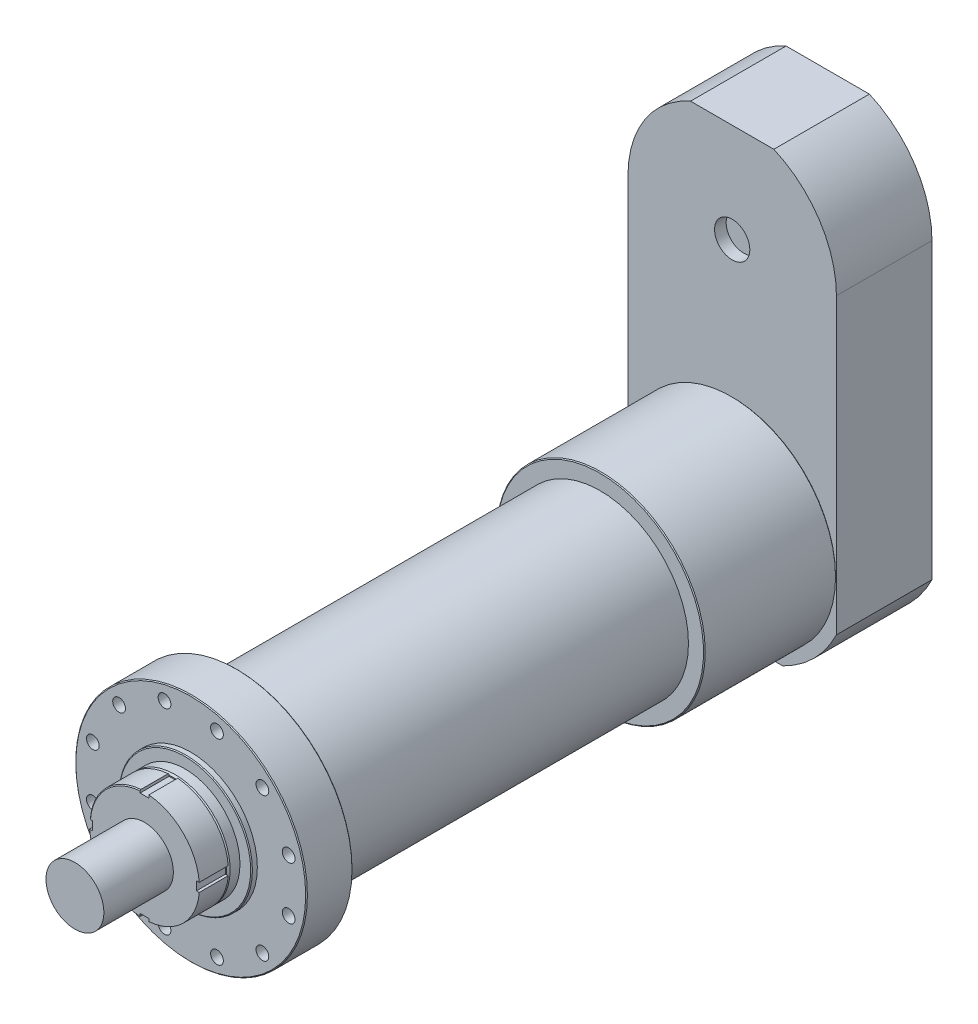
ISO-10303-21;
HEADER;
FILE_DESCRIPTION(('STEP AP214'),'2;1');
FILE_NAME('part.step','',(''),(''),'','','');
FILE_SCHEMA(('AUTOMOTIVE_DESIGN { 1 0 10303 214 1 1 1 1 }'));
ENDSEC;
DATA;
#1=APPLICATION_CONTEXT('core data for automotive mechanical design processes');
#2=APPLICATION_PROTOCOL_DEFINITION('international standard','automotive_design',2000,#1);
#3=PRODUCT_CONTEXT('',#1,'mechanical');
#4=PRODUCT('Part','Part','',(#3));
#5=PRODUCT_RELATED_PRODUCT_CATEGORY('part','',(#4));
#6=PRODUCT_DEFINITION_FORMATION('','',#4);
#7=PRODUCT_DEFINITION_CONTEXT('part definition',#1,'design');
#8=PRODUCT_DEFINITION('design','',#6,#7);
#9=PRODUCT_DEFINITION_SHAPE('','',#8);
#10=(LENGTH_UNIT() NAMED_UNIT(*) SI_UNIT(.MILLI.,.METRE.));
#11=(NAMED_UNIT(*) PLANE_ANGLE_UNIT() SI_UNIT($,.RADIAN.));
#12=(NAMED_UNIT(*) SI_UNIT($,.STERADIAN.) SOLID_ANGLE_UNIT());
#13=UNCERTAINTY_MEASURE_WITH_UNIT(LENGTH_MEASURE(1.E-05),#10,'distance_accuracy_value','');
#14=(GEOMETRIC_REPRESENTATION_CONTEXT(3) GLOBAL_UNCERTAINTY_ASSIGNED_CONTEXT((#13)) GLOBAL_UNIT_ASSIGNED_CONTEXT((#10,
#11,#12)) REPRESENTATION_CONTEXT('',''));
#15=CARTESIAN_POINT('',(0.,0.,0.));
#16=DIRECTION('',(0.,0.,1.));
#17=DIRECTION('',(1.,0.,0.));
#18=AXIS2_PLACEMENT_3D('',#15,#16,#17);
#19=CARTESIAN_POINT('',(0.,-180.,-393.));
#20=DIRECTION('',(0.,1.,0.));
#21=DIRECTION('',(-1.,0.,0.));
#22=AXIS2_PLACEMENT_3D('',#19,#20,#21);
#23=PLANE('',#22);
#24=DIRECTION('',(-1.,0.,0.));
#25=VECTOR('',#24,1.);
#26=CARTESIAN_POINT('',(0.,-180.,-228.));
#27=LINE('',#26,#25);
#28=CARTESIAN_POINT('',(87.1779788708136,-180.,-228.));
#29=VERTEX_POINT('',#28);
#30=CARTESIAN_POINT('',(-87.1779788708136,-180.,-228.));
#31=VERTEX_POINT('',#30);
#32=EDGE_CURVE('E145',#29,#31,#27,.T.);
#33=ORIENTED_EDGE('',*,*,#32,.T.);
#34=DIRECTION('',(0.,0.,1.));
#35=VECTOR('',#34,1.);
#36=CARTESIAN_POINT('',(-87.1779788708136,-180.,-393.));
#37=LINE('',#36,#35);
#38=CARTESIAN_POINT('',(-87.1779788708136,-180.,-393.));
#39=VERTEX_POINT('',#38);
#40=EDGE_CURVE('E12',#39,#31,#37,.T.);
#41=ORIENTED_EDGE('',*,*,#40,.F.);
#42=DIRECTION('',(-1.,0.,0.));
#43=VECTOR('',#42,1.);
#44=CARTESIAN_POINT('',(0.,-180.,-393.));
#45=LINE('',#44,#43);
#46=CARTESIAN_POINT('',(87.1779788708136,-180.,-393.));
#47=VERTEX_POINT('',#46);
#48=EDGE_CURVE('E163',#47,#39,#45,.T.);
#49=ORIENTED_EDGE('',*,*,#48,.F.);
#50=DIRECTION('',(0.,0.,1.));
#51=VECTOR('',#50,1.);
#52=CARTESIAN_POINT('',(87.1779788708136,-180.,-393.));
#53=LINE('',#52,#51);
#54=EDGE_CURVE('E141',#47,#29,#53,.T.);
#55=ORIENTED_EDGE('',*,*,#54,.T.);
#56=EDGE_LOOP('',(#33,#41,#49,#55));
#57=FACE_BOUND('',#56,.T.);
#58=ADVANCED_FACE('F51',(#57),#23,.F.);
#59=CARTESIAN_POINT('',(0.,0.,-393.));
#60=DIRECTION('',(0.,0.,1.));
#61=DIRECTION('',(1.,0.,0.));
#62=AXIS2_PLACEMENT_3D('',#59,#60,#61);
#63=CYLINDRICAL_SURFACE('',#62,200.);
#64=CARTESIAN_POINT('',(0.,0.,-228.));
#65=DIRECTION('',(0.,0.,-1.));
#66=DIRECTION('',(-1.,0.,0.));
#67=AXIS2_PLACEMENT_3D('',#64,#65,#66);
#68=CIRCLE('',#67,200.);
#69=CARTESIAN_POINT('',(-180.,-87.1779788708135,-228.));
#70=VERTEX_POINT('',#69);
#71=EDGE_CURVE('E148',#31,#70,#68,.T.);
#72=ORIENTED_EDGE('',*,*,#71,.T.);
#73=DIRECTION('',(0.,0.,1.));
#74=VECTOR('',#73,1.);
#75=CARTESIAN_POINT('',(-180.,-87.1779788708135,-393.));
#76=LINE('',#75,#74);
#77=CARTESIAN_POINT('',(-180.,-87.1779788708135,-393.));
#78=VERTEX_POINT('',#77);
#79=EDGE_CURVE('E59',#78,#70,#76,.T.);
#80=ORIENTED_EDGE('',*,*,#79,.F.);
#81=CARTESIAN_POINT('',(0.,0.,-393.));
#82=DIRECTION('',(0.,0.,-1.));
#83=DIRECTION('',(-1.,0.,0.));
#84=AXIS2_PLACEMENT_3D('',#81,#82,#83);
#85=CIRCLE('',#84,200.);
#86=EDGE_CURVE('E106',#39,#78,#85,.T.);
#87=ORIENTED_EDGE('',*,*,#86,.F.);
#88=ORIENTED_EDGE('',*,*,#40,.T.);
#89=EDGE_LOOP('',(#72,#80,#87,#88));
#90=FACE_BOUND('',#89,.T.);
#91=ADVANCED_FACE('F216',(#90),#63,.T.);
#92=CARTESIAN_POINT('',(-180.,0.,-393.));
#93=DIRECTION('',(1.,0.,0.));
#94=DIRECTION('',(0.,0.,-1.));
#95=AXIS2_PLACEMENT_3D('',#92,#93,#94);
#96=PLANE('',#95);
#97=DIRECTION('',(0.,1.,0.));
#98=VECTOR('',#97,1.);
#99=CARTESIAN_POINT('',(-180.,0.,-228.));
#100=LINE('',#99,#98);
#101=CARTESIAN_POINT('',(-180.,420.,-228.));
#102=VERTEX_POINT('',#101);
#103=EDGE_CURVE('E151',#70,#102,#100,.T.);
#104=ORIENTED_EDGE('',*,*,#103,.T.);
#105=DIRECTION('',(0.,0.,1.));
#106=VECTOR('',#105,1.);
#107=CARTESIAN_POINT('',(-180.,420.,-393.));
#108=LINE('',#107,#106);
#109=CARTESIAN_POINT('',(-180.,420.,-393.));
#110=VERTEX_POINT('',#109);
#111=EDGE_CURVE('E169',#110,#102,#108,.T.);
#112=ORIENTED_EDGE('',*,*,#111,.F.);
#113=DIRECTION('',(0.,1.,0.));
#114=VECTOR('',#113,1.);
#115=CARTESIAN_POINT('',(-180.,0.,-393.));
#116=LINE('',#115,#114);
#117=EDGE_CURVE('E177',#78,#110,#116,.T.);
#118=ORIENTED_EDGE('',*,*,#117,.F.);
#119=ORIENTED_EDGE('',*,*,#79,.T.);
#120=EDGE_LOOP('',(#104,#112,#118,#119));
#121=FACE_BOUND('',#120,.T.);
#122=ADVANCED_FACE('F175',(#121),#96,.F.);
#123=CARTESIAN_POINT('',(0.,420.,-393.));
#124=DIRECTION('',(0.,0.,1.));
#125=DIRECTION('',(1.,0.,0.));
#126=AXIS2_PLACEMENT_3D('',#123,#124,#125);
#127=CYLINDRICAL_SURFACE('',#126,180.);
#128=CARTESIAN_POINT('',(0.,420.,-228.));
#129=DIRECTION('',(0.,0.,-1.));
#130=DIRECTION('',(-1.,0.,0.));
#131=AXIS2_PLACEMENT_3D('',#128,#129,#130);
#132=CIRCLE('',#131,180.);
#133=CARTESIAN_POINT('',(-71.9374728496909,585.,-228.));
#134=VERTEX_POINT('',#133);
#135=EDGE_CURVE('E153',#102,#134,#132,.T.);
#136=ORIENTED_EDGE('',*,*,#135,.T.);
#137=DIRECTION('',(0.,0.,1.));
#138=VECTOR('',#137,1.);
#139=CARTESIAN_POINT('',(-71.9374728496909,585.,-393.));
#140=LINE('',#139,#138);
#141=CARTESIAN_POINT('',(-71.9374728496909,585.,-393.));
#142=VERTEX_POINT('',#141);
#143=EDGE_CURVE('E167',#142,#134,#140,.T.);
#144=ORIENTED_EDGE('',*,*,#143,.F.);
#145=CARTESIAN_POINT('',(0.,420.,-393.));
#146=DIRECTION('',(0.,0.,-1.));
#147=DIRECTION('',(-1.,0.,0.));
#148=AXIS2_PLACEMENT_3D('',#145,#146,#147);
#149=CIRCLE('',#148,180.);
#150=EDGE_CURVE('E187',#110,#142,#149,.T.);
#151=ORIENTED_EDGE('',*,*,#150,.F.);
#152=ORIENTED_EDGE('',*,*,#111,.T.);
#153=EDGE_LOOP('',(#136,#144,#151,#152));
#154=FACE_BOUND('',#153,.T.);
#155=ADVANCED_FACE('F185',(#154),#127,.T.);
#156=CARTESIAN_POINT('',(0.,585.,-393.));
#157=DIRECTION('',(0.,1.,0.));
#158=DIRECTION('',(0.,0.,1.));
#159=AXIS2_PLACEMENT_3D('',#156,#157,#158);
#160=PLANE('',#159);
#161=DIRECTION('',(-1.,0.,0.));
#162=VECTOR('',#161,1.);
#163=CARTESIAN_POINT('',(0.,585.,-228.));
#164=LINE('',#163,#162);
#165=CARTESIAN_POINT('',(71.9374728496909,585.,-228.));
#166=VERTEX_POINT('',#165);
#167=EDGE_CURVE('E156',#166,#134,#164,.T.);
#168=ORIENTED_EDGE('',*,*,#167,.F.);
#169=DIRECTION('',(0.,0.,1.));
#170=VECTOR('',#169,1.);
#171=CARTESIAN_POINT('',(71.9374728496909,585.,-393.));
#172=LINE('',#171,#170);
#173=CARTESIAN_POINT('',(71.9374728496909,585.,-393.));
#174=VERTEX_POINT('',#173);
#175=EDGE_CURVE('E137',#174,#166,#172,.T.);
#176=ORIENTED_EDGE('',*,*,#175,.F.);
#177=DIRECTION('',(-1.,0.,0.));
#178=VECTOR('',#177,1.);
#179=CARTESIAN_POINT('',(0.,585.,-393.));
#180=LINE('',#179,#178);
#181=EDGE_CURVE('E126',#174,#142,#180,.T.);
#182=ORIENTED_EDGE('',*,*,#181,.T.);
#183=ORIENTED_EDGE('',*,*,#143,.T.);
#184=EDGE_LOOP('',(#168,#176,#182,#183));
#185=FACE_BOUND('',#184,.T.);
#186=ADVANCED_FACE('F224',(#185),#160,.T.);
#187=CARTESIAN_POINT('',(0.,420.,-393.));
#188=DIRECTION('',(0.,0.,1.));
#189=DIRECTION('',(1.,0.,0.));
#190=AXIS2_PLACEMENT_3D('',#187,#188,#189);
#191=CYLINDRICAL_SURFACE('',#190,180.);
#192=CARTESIAN_POINT('',(0.,420.,-228.));
#193=DIRECTION('',(0.,0.,-1.));
#194=DIRECTION('',(-1.,0.,0.));
#195=AXIS2_PLACEMENT_3D('',#192,#193,#194);
#196=CIRCLE('',#195,180.);
#197=CARTESIAN_POINT('',(180.,420.,-228.));
#198=VERTEX_POINT('',#197);
#199=EDGE_CURVE('E133',#166,#198,#196,.T.);
#200=ORIENTED_EDGE('',*,*,#199,.T.);
#201=DIRECTION('',(0.,0.,1.));
#202=VECTOR('',#201,1.);
#203=CARTESIAN_POINT('',(180.,420.,-393.));
#204=LINE('',#203,#202);
#205=CARTESIAN_POINT('',(180.,420.,-393.));
#206=VERTEX_POINT('',#205);
#207=EDGE_CURVE('E130',#206,#198,#204,.T.);
#208=ORIENTED_EDGE('',*,*,#207,.F.);
#209=CARTESIAN_POINT('',(0.,420.,-393.));
#210=DIRECTION('',(0.,0.,-1.));
#211=DIRECTION('',(-1.,0.,0.));
#212=AXIS2_PLACEMENT_3D('',#209,#210,#211);
#213=CIRCLE('',#212,180.);
#214=EDGE_CURVE('E120',#174,#206,#213,.T.);
#215=ORIENTED_EDGE('',*,*,#214,.F.);
#216=ORIENTED_EDGE('',*,*,#175,.T.);
#217=EDGE_LOOP('',(#200,#208,#215,#216));
#218=FACE_BOUND('',#217,.T.);
#219=ADVANCED_FACE('F131',(#218),#191,.T.);
#220=CARTESIAN_POINT('',(180.,0.,-393.));
#221=DIRECTION('',(1.,0.,0.));
#222=DIRECTION('',(0.,0.,-1.));
#223=AXIS2_PLACEMENT_3D('',#220,#221,#222);
#224=PLANE('',#223);
#225=DIRECTION('',(0.,1.,0.));
#226=VECTOR('',#225,1.);
#227=CARTESIAN_POINT('',(180.,0.,-228.));
#228=LINE('',#227,#226);
#229=CARTESIAN_POINT('',(180.,-87.1779788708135,-228.));
#230=VERTEX_POINT('',#229);
#231=EDGE_CURVE('E160',#230,#198,#228,.T.);
#232=ORIENTED_EDGE('',*,*,#231,.F.);
#233=DIRECTION('',(0.,0.,1.));
#234=VECTOR('',#233,1.);
#235=CARTESIAN_POINT('',(180.,-87.1779788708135,-393.));
#236=LINE('',#235,#234);
#237=CARTESIAN_POINT('',(180.,-87.1779788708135,-393.));
#238=VERTEX_POINT('',#237);
#239=EDGE_CURVE('E95',#238,#230,#236,.T.);
#240=ORIENTED_EDGE('',*,*,#239,.F.);
#241=DIRECTION('',(0.,1.,0.));
#242=VECTOR('',#241,1.);
#243=CARTESIAN_POINT('',(180.,0.,-393.));
#244=LINE('',#243,#242);
#245=EDGE_CURVE('E124',#238,#206,#244,.T.);
#246=ORIENTED_EDGE('',*,*,#245,.T.);
#247=ORIENTED_EDGE('',*,*,#207,.T.);
#248=EDGE_LOOP('',(#232,#240,#246,#247));
#249=FACE_BOUND('',#248,.T.);
#250=ADVANCED_FACE('F139',(#249),#224,.T.);
#251=CARTESIAN_POINT('',(0.,0.,-393.));
#252=DIRECTION('',(0.,0.,1.));
#253=DIRECTION('',(1.,0.,0.));
#254=AXIS2_PLACEMENT_3D('',#251,#252,#253);
#255=CYLINDRICAL_SURFACE('',#254,200.);
#256=CARTESIAN_POINT('',(0.,0.,-228.));
#257=DIRECTION('',(0.,0.,-1.));
#258=DIRECTION('',(-1.,0.,0.));
#259=AXIS2_PLACEMENT_3D('',#256,#257,#258);
#260=CIRCLE('',#259,200.);
#261=EDGE_CURVE('E98',#230,#29,#260,.T.);
#262=ORIENTED_EDGE('',*,*,#261,.T.);
#263=ORIENTED_EDGE('',*,*,#54,.F.);
#264=CARTESIAN_POINT('',(0.,0.,-393.));
#265=DIRECTION('',(0.,0.,-1.));
#266=DIRECTION('',(-1.,0.,0.));
#267=AXIS2_PLACEMENT_3D('',#264,#265,#266);
#268=CIRCLE('',#267,200.);
#269=EDGE_CURVE('E67',#238,#47,#268,.T.);
#270=ORIENTED_EDGE('',*,*,#269,.F.);
#271=ORIENTED_EDGE('',*,*,#239,.T.);
#272=EDGE_LOOP('',(#262,#263,#270,#271));
#273=FACE_BOUND('',#272,.T.);
#274=ADVANCED_FACE('F212',(#273),#255,.T.);
#275=CARTESIAN_POINT('',(0.,0.,-393.));
#276=DIRECTION('',(0.,0.,-1.));
#277=DIRECTION('',(-1.,0.,0.));
#278=AXIS2_PLACEMENT_3D('',#275,#276,#277);
#279=PLANE('',#278);
#280=ORIENTED_EDGE('',*,*,#48,.T.);
#281=ORIENTED_EDGE('',*,*,#86,.T.);
#282=ORIENTED_EDGE('',*,*,#117,.T.);
#283=ORIENTED_EDGE('',*,*,#150,.T.);
#284=ORIENTED_EDGE('',*,*,#181,.F.);
#285=ORIENTED_EDGE('',*,*,#214,.T.);
#286=ORIENTED_EDGE('',*,*,#245,.F.);
#287=ORIENTED_EDGE('',*,*,#269,.T.);
#288=EDGE_LOOP('',(#280,#281,#282,#283,#284,#285,#286,#287));
#289=FACE_BOUND('',#288,.T.);
#290=ADVANCED_FACE('F122',(#289),#279,.T.);
#291=CARTESIAN_POINT('',(0.,0.,-228.));
#292=DIRECTION('',(0.,0.,-1.));
#293=DIRECTION('',(-1.,0.,0.));
#294=AXIS2_PLACEMENT_3D('',#291,#292,#293);
#295=PLANE('',#294);
#296=CARTESIAN_POINT('',(0.,414.,-228.));
#297=DIRECTION('',(0.,0.,1.));
#298=DIRECTION('',(1.,0.,0.));
#299=AXIS2_PLACEMENT_3D('',#296,#297,#298);
#300=CIRCLE('',#299,30.4407465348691);
#301=CARTESIAN_POINT('',(30.4407465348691,414.,-228.));
#302=VERTEX_POINT('',#301);
#303=EDGE_CURVE('E193',#302,#302,#300,.T.);
#304=ORIENTED_EDGE('',*,*,#303,.F.);
#305=EDGE_LOOP('',(#304));
#306=FACE_BOUND('',#305,.T.);
#307=ORIENTED_EDGE('',*,*,#32,.F.);
#308=ORIENTED_EDGE('',*,*,#261,.F.);
#309=ORIENTED_EDGE('',*,*,#231,.T.);
#310=ORIENTED_EDGE('',*,*,#199,.F.);
#311=ORIENTED_EDGE('',*,*,#167,.T.);
#312=ORIENTED_EDGE('',*,*,#135,.F.);
#313=ORIENTED_EDGE('',*,*,#103,.F.);
#314=ORIENTED_EDGE('',*,*,#71,.F.);
#315=EDGE_LOOP('',(#307,#308,#309,#310,#311,#312,#313,#314));
#316=FACE_BOUND('',#315,.T.);
#317=ADVANCED_FACE('F181',(#306,#316),#295,.F.);
#318=CARTESIAN_POINT('',(0.,414.,-248.));
#319=DIRECTION('',(0.,0.,1.));
#320=DIRECTION('',(1.,0.,0.));
#321=AXIS2_PLACEMENT_3D('',#318,#319,#320);
#322=CYLINDRICAL_SURFACE('',#321,30.4407465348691);
#323=CARTESIAN_POINT('',(0.,414.,-248.));
#324=DIRECTION('',(0.,0.,1.));
#325=DIRECTION('',(1.,0.,0.));
#326=AXIS2_PLACEMENT_3D('',#323,#324,#325);
#327=CIRCLE('',#326,30.4407465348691);
#328=CARTESIAN_POINT('',(30.4407465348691,414.,-248.));
#329=VERTEX_POINT('',#328);
#330=EDGE_CURVE('E149',#329,#329,#327,.T.);
#331=ORIENTED_EDGE('',*,*,#330,.F.);
#332=EDGE_LOOP('',(#331));
#333=FACE_BOUND('',#332,.T.);
#334=ORIENTED_EDGE('',*,*,#303,.T.);
#335=EDGE_LOOP('',(#334));
#336=FACE_BOUND('',#335,.T.);
#337=ADVANCED_FACE('F201',(#333,#336),#322,.F.);
#338=CARTESIAN_POINT('',(0.,414.,-248.));
#339=DIRECTION('',(0.,0.,1.));
#340=DIRECTION('',(1.,0.,0.));
#341=AXIS2_PLACEMENT_3D('',#338,#339,#340);
#342=PLANE('',#341);
#343=ORIENTED_EDGE('',*,*,#330,.T.);
#344=EDGE_LOOP('',(#343));
#345=FACE_BOUND('',#344,.T.);
#346=ADVANCED_FACE('F199',(#345),#342,.T.);
#347=CLOSED_SHELL('',(#58,#91,#122,#155,#186,#219,#250,#274,#290,#317,#337,#346));
#348=MANIFOLD_SOLID_BREP('B2',#347);
#349=CARTESIAN_POINT('',(0.,0.,627.));
#350=DIRECTION('',(0.,0.,-1.));
#351=DIRECTION('',(-1.,0.,0.));
#352=AXIS2_PLACEMENT_3D('',#349,#350,#351);
#353=CYLINDRICAL_SURFACE('',#352,152.5);
#354=CARTESIAN_POINT('',(0.,0.,627.));
#355=DIRECTION('',(0.,0.,1.));
#356=DIRECTION('',(1.,0.,0.));
#357=AXIS2_PLACEMENT_3D('',#354,#355,#356);
#358=CIRCLE('',#357,152.5);
#359=CARTESIAN_POINT('',(152.5,0.,627.));
#360=VERTEX_POINT('',#359);
#361=EDGE_CURVE('E509',#360,#360,#358,.T.);
#362=ORIENTED_EDGE('',*,*,#361,.F.);
#363=EDGE_LOOP('',(#362));
#364=FACE_BOUND('',#363,.T.);
#365=CARTESIAN_POINT('',(0.,0.,0.));
#366=DIRECTION('',(0.,0.,1.));
#367=DIRECTION('',(1.,0.,0.));
#368=AXIS2_PLACEMENT_3D('',#365,#366,#367);
#369=CIRCLE('',#368,152.5);
#370=CARTESIAN_POINT('',(152.5,0.,0.));
#371=VERTEX_POINT('',#370);
#372=EDGE_CURVE('E609',#371,#371,#369,.T.);
#373=ORIENTED_EDGE('',*,*,#372,.T.);
#374=EDGE_LOOP('',(#373));
#375=FACE_BOUND('',#374,.T.);
#376=CARTESIAN_POINT('',(-152.5,0.,567.5));
#377=CARTESIAN_POINT('',(-152.500001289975,0.448200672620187,567.500004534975));
#378=CARTESIAN_POINT('',(-152.49802011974,0.896332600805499,567.481160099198));
#379=CARTESIAN_POINT('',(-152.49015354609,1.7895422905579,567.405923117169));
#380=CARTESIAN_POINT('',(-152.48426721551,2.23461930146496,567.349521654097));
#381=CARTESIAN_POINT('',(-152.46874661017,3.11882436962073,567.19949799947));
#382=CARTESIAN_POINT('',(-152.459108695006,3.55794621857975,567.105839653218));
#383=CARTESIAN_POINT('',(-152.436358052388,4.42668632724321,566.881990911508));
#384=CARTESIAN_POINT('',(-152.423245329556,4.8563045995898,566.75180056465));
#385=CARTESIAN_POINT('',(-152.393924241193,5.70272636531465,566.455928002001));
#386=CARTESIAN_POINT('',(-152.377717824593,6.11953773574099,566.290268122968));
#387=CARTESIAN_POINT('',(-152.342659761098,6.93770102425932,565.924599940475));
#388=CARTESIAN_POINT('',(-152.323808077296,7.33905272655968,565.724591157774));
#389=CARTESIAN_POINT('',(-152.283993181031,8.12339897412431,565.291700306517));
#390=CARTESIAN_POINT('',(-152.263030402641,8.50639726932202,565.058824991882));
#391=CARTESIAN_POINT('',(-152.219577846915,9.25145377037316,564.561819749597));
#392=CARTESIAN_POINT('',(-152.197088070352,9.61351198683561,564.297689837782));
#393=CARTESIAN_POINT('',(-152.151130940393,10.3154013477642,563.739051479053));
#394=CARTESIAN_POINT('',(-152.127660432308,10.6551500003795,563.444439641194));
#395=CARTESIAN_POINT('',(-152.080478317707,11.3086456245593,562.82768277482));
#396=CARTESIAN_POINT('',(-152.056766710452,11.6223925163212,562.505537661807));
#397=CARTESIAN_POINT('',(-152.009771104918,12.2216965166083,561.835957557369));
#398=CARTESIAN_POINT('',(-151.986487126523,12.5072523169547,561.488521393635));
#399=CARTESIAN_POINT('',(-151.941006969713,13.0481450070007,560.770805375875));
#400=CARTESIAN_POINT('',(-151.918810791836,13.3034818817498,560.400525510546));
#401=CARTESIAN_POINT('',(-151.87608610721,13.7826883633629,559.638822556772));
#402=CARTESIAN_POINT('',(-151.855561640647,14.0064826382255,559.247351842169));
#403=CARTESIAN_POINT('',(-151.816825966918,14.420283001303,558.446830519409));
#404=CARTESIAN_POINT('',(-151.798614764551,14.6102890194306,558.037779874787));
#405=CARTESIAN_POINT('',(-151.765029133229,14.9551317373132,557.205009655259));
#406=CARTESIAN_POINT('',(-151.74965464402,15.1099691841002,556.781290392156));
#407=CARTESIAN_POINT('',(-151.722185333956,15.3833471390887,555.922196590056));
#408=CARTESIAN_POINT('',(-151.710090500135,15.5018877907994,555.486822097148));
#409=CARTESIAN_POINT('',(-151.689568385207,15.7014291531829,554.609163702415));
#410=CARTESIAN_POINT('',(-151.681127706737,15.7825670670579,554.166911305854));
#411=CARTESIAN_POINT('',(-151.668092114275,15.9073498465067,553.277092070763));
#412=CARTESIAN_POINT('',(-151.663497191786,15.9509947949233,552.829525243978));
#413=CARTESIAN_POINT('',(-151.658285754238,16.0004682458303,551.932294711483));
#414=CARTESIAN_POINT('',(-151.657669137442,16.0062977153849,551.482631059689));
#415=CARTESIAN_POINT('',(-151.660431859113,15.9800995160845,550.584420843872));
#416=CARTESIAN_POINT('',(-151.663811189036,15.9480719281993,550.135874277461));
#417=CARTESIAN_POINT('',(-151.674446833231,15.8466008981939,549.244901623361));
#418=CARTESIAN_POINT('',(-151.681687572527,15.7773077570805,548.802458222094));
#419=CARTESIAN_POINT('',(-151.699829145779,15.6019101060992,547.9250074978));
#420=CARTESIAN_POINT('',(-151.710729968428,15.4958057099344,547.490000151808));
#421=CARTESIAN_POINT('',(-151.735880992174,15.2475561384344,546.630489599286));
#422=CARTESIAN_POINT('',(-151.750131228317,15.1054105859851,546.205986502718));
#423=CARTESIAN_POINT('',(-151.781575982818,14.7861052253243,545.370472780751));
#424=CARTESIAN_POINT('',(-151.798770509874,14.6089453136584,544.959462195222));
#425=CARTESIAN_POINT('',(-151.83565305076,14.2204984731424,544.15301924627));
#426=CARTESIAN_POINT('',(-151.855345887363,14.0091453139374,543.7576190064));
#427=CARTESIAN_POINT('',(-151.896640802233,13.5540653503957,542.986015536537));
#428=CARTESIAN_POINT('',(-151.918242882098,13.3103385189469,542.609812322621));
#429=CARTESIAN_POINT('',(-151.962747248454,12.7922253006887,541.879213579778));
#430=CARTESIAN_POINT('',(-151.985649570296,12.5178380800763,541.52481864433));
#431=CARTESIAN_POINT('',(-152.032109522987,11.9403334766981,540.840311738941));
#432=CARTESIAN_POINT('',(-152.055667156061,11.6372159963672,540.510199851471));
#433=CARTESIAN_POINT('',(-152.102890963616,11.0028265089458,539.875015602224));
#434=CARTESIAN_POINT('',(-152.126557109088,10.6714248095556,539.570072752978));
#435=CARTESIAN_POINT('',(-152.173213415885,9.98407466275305,538.989175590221));
#436=CARTESIAN_POINT('',(-152.196203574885,9.62812613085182,538.713221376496));
#437=CARTESIAN_POINT('',(-152.240857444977,8.89418144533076,538.19225578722));
#438=CARTESIAN_POINT('',(-152.262521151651,8.516185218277,537.94724451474));
#439=CARTESIAN_POINT('',(-152.303908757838,7.74080626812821,537.489914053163));
#440=CARTESIAN_POINT('',(-152.323632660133,7.34342357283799,537.27759481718));
#441=CARTESIAN_POINT('',(-152.360585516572,6.53199332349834,536.887135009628));
#442=CARTESIAN_POINT('',(-152.377813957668,6.11794236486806,536.709001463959));
#443=CARTESIAN_POINT('',(-152.409281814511,5.27618993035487,536.38826037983));
#444=CARTESIAN_POINT('',(-152.423521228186,4.84848844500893,536.245652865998));
#445=CARTESIAN_POINT('',(-152.448605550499,3.98249754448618,535.997011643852));
#446=CARTESIAN_POINT('',(-152.459450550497,3.54420841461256,535.89097695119));
#447=CARTESIAN_POINT('',(-152.477437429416,2.66017303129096,535.716258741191));
#448=CARTESIAN_POINT('',(-152.484579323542,2.21442680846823,535.647575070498));
#449=CARTESIAN_POINT('',(-152.494931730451,1.32080186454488,535.548303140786));
#450=CARTESIAN_POINT('',(-152.498160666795,0.872943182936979,535.517536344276));
#451=CARTESIAN_POINT('',(-152.500657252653,-0.0237861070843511,535.493732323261));
#452=CARTESIAN_POINT('',(-152.499924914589,-0.472656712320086,535.50069498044));
#453=CARTESIAN_POINT('',(-152.494519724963,-1.36819608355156,535.552297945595));
#454=CARTESIAN_POINT('',(-152.489846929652,-1.8148648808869,535.596937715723));
#455=CARTESIAN_POINT('',(-152.476693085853,-2.70281936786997,535.723565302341));
#456=CARTESIAN_POINT('',(-152.468212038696,-3.14410505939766,535.805553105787));
#457=CARTESIAN_POINT('',(-152.447704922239,-4.01715075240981,536.006044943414));
#458=CARTESIAN_POINT('',(-152.435687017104,-4.44893025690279,536.124464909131));
#459=CARTESIAN_POINT('',(-152.408436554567,-5.30095814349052,536.397023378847));
#460=CARTESIAN_POINT('',(-152.393204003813,-5.72120654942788,536.551161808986));
#461=CARTESIAN_POINT('',(-152.359950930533,-6.54723091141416,536.894051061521));
#462=CARTESIAN_POINT('',(-152.34193035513,-6.95300659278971,537.082802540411));
#463=CARTESIAN_POINT('',(-152.303605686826,-7.74724407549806,537.493569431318));
#464=CARTESIAN_POINT('',(-152.28330158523,-8.13570581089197,537.715584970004));
#465=CARTESIAN_POINT('',(-152.240899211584,-8.89400737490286,538.192186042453));
#466=CARTESIAN_POINT('',(-152.218794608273,-9.26377336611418,538.446888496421));
#467=CARTESIAN_POINT('',(-152.173478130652,-9.98055818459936,538.986420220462));
#468=CARTESIAN_POINT('',(-152.150266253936,-10.3275769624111,539.27124955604));
#469=CARTESIAN_POINT('',(-152.103387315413,-10.9964538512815,539.869041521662));
#470=CARTESIAN_POINT('',(-152.079720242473,-11.3183113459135,540.182004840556));
#471=CARTESIAN_POINT('',(-152.032597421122,-11.9346077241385,540.8338700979));
#472=CARTESIAN_POINT('',(-152.009141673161,-12.2290465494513,541.172772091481));
#473=CARTESIAN_POINT('',(-151.963011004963,-12.7895544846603,541.875546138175));
#474=CARTESIAN_POINT('',(-151.940339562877,-13.0555060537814,542.239512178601));
#475=CARTESIAN_POINT('',(-151.896521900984,-13.5558001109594,542.988645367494));
#476=CARTESIAN_POINT('',(-151.875375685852,-13.7901425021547,543.373812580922));
#477=CARTESIAN_POINT('',(-151.835213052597,-14.2255368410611,544.162626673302));
#478=CARTESIAN_POINT('',(-151.816196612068,-14.426589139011,544.566273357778));
#479=CARTESIAN_POINT('',(-151.780838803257,-14.7939530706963,545.389190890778));
#480=CARTESIAN_POINT('',(-151.764497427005,-14.9602648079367,545.808461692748));
#481=CARTESIAN_POINT('',(-151.734988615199,-15.256650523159,546.658825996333));
#482=CARTESIAN_POINT('',(-151.721815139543,-15.3867935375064,547.089895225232));
#483=CARTESIAN_POINT('',(-151.698980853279,-15.6103121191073,547.961555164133));
#484=CARTESIAN_POINT('',(-151.689320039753,-15.7036877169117,548.402145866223));
#485=CARTESIAN_POINT('',(-151.673790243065,-15.8529806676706,549.289683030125));
#486=CARTESIAN_POINT('',(-151.667921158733,-15.908899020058,549.736629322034));
#487=CARTESIAN_POINT('',(-151.660144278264,-15.9828666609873,550.633678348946));
#488=CARTESIAN_POINT('',(-151.658236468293,-16.0009160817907,551.08378107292));
#489=CARTESIAN_POINT('',(-151.658436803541,-15.9990169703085,551.981712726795));
#490=CARTESIAN_POINT('',(-151.660525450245,-15.979252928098,552.429542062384));
#491=CARTESIAN_POINT('',(-151.668620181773,-15.9022371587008,553.321928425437));
#492=CARTESIAN_POINT('',(-151.674626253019,-15.8449855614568,553.766485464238));
#493=CARTESIAN_POINT('',(-151.69038372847,-15.6934151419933,554.649166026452));
#494=CARTESIAN_POINT('',(-151.700135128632,-15.5990963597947,555.087289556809));
#495=CARTESIAN_POINT('',(-151.723104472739,-15.3740802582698,555.953999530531));
#496=CARTESIAN_POINT('',(-151.736322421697,-15.2433828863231,556.382585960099));
#497=CARTESIAN_POINT('',(-151.76584549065,-14.9465835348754,557.227123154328));
#498=CARTESIAN_POINT('',(-151.782150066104,-14.7804877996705,557.643076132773));
#499=CARTESIAN_POINT('',(-151.817384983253,-14.4140719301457,558.459506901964));
#500=CARTESIAN_POINT('',(-151.836315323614,-14.2137518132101,558.859984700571));
#501=CARTESIAN_POINT('',(-151.876266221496,-13.7803156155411,559.642666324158));
#502=CARTESIAN_POINT('',(-151.897286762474,-13.5471997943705,560.024870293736));
#503=CARTESIAN_POINT('',(-151.940825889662,-13.0498169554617,560.768350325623));
#504=CARTESIAN_POINT('',(-151.963344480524,-12.7855498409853,561.129626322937));
#505=CARTESIAN_POINT('',(-152.009354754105,-12.226409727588,561.830380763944));
#506=CARTESIAN_POINT('',(-152.032850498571,-11.9313992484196,562.169749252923));
#507=CARTESIAN_POINT('',(-152.080051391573,-11.3138777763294,562.822456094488));
#508=CARTESIAN_POINT('',(-152.103756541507,-10.9913665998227,563.135794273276));
#509=CARTESIAN_POINT('',(-152.150712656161,-10.3210235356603,563.734313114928));
#510=CARTESIAN_POINT('',(-152.173963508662,-9.97318548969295,564.019486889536));
#511=CARTESIAN_POINT('',(-152.21934851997,-9.25470030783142,564.559575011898));
#512=CARTESIAN_POINT('',(-152.241482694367,-8.88405349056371,564.814489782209));
#513=CARTESIAN_POINT('',(-152.284068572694,-8.12149344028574,565.292914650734));
#514=CARTESIAN_POINT('',(-152.304515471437,-7.72952441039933,565.516336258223));
#515=CARTESIAN_POINT('',(-152.343077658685,-6.92803336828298,565.929331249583));
#516=CARTESIAN_POINT('',(-152.36119294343,-6.51851132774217,566.118904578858));
#517=CARTESIAN_POINT('',(-152.394559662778,-5.68522805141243,566.462656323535));
#518=CARTESIAN_POINT('',(-152.409813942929,-5.26148146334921,566.616869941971));
#519=CARTESIAN_POINT('',(-152.437044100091,-4.4025312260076,566.888979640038));
#520=CARTESIAN_POINT('',(-152.449020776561,-3.96733039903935,567.006884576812));
#521=CARTESIAN_POINT('',(-152.472564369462,-2.94974180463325,567.23690209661));
#522=CARTESIAN_POINT('',(-152.482811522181,-2.36420974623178,567.335467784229));
#523=CARTESIAN_POINT('',(-152.496528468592,-1.1857450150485,567.467013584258));
#524=CARTESIAN_POINT('',(-152.499998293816,-0.592812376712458,567.499994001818));
#525=CARTESIAN_POINT('',(-152.5,0.,567.5));
#526=B_SPLINE_CURVE_WITH_KNOTS('',3,(#376,#377,#378,#379,#380,#381,#382,#383,#384,#385,#386,
#387,#388,#389,#390,#391,#392,#393,#394,#395,#396,#397,#398,#399,#400,#401,#402,#403,#404,#405,
#406,#407,#408,#409,#410,#411,#412,#413,#414,#415,#416,#417,#418,#419,#420,#421,#422,#423,#424,
#425,#426,#427,#428,#429,#430,#431,#432,#433,#434,#435,#436,#437,#438,#439,#440,#441,#442,#443,
#444,#445,#446,#447,#448,#449,#450,#451,#452,#453,#454,#455,#456,#457,#458,#459,#460,#461,#462,
#463,#464,#465,#466,#467,#468,#469,#470,#471,#472,#473,#474,#475,#476,#477,#478,#479,#480,#481,
#482,#483,#484,#485,#486,#487,#488,#489,#490,#491,#492,#493,#494,#495,#496,#497,#498,#499,#500,
#501,#502,#503,#504,#505,#506,#507,#508,#509,#510,#511,#512,#513,#514,#515,#516,#517,#518,#519,
#520,#521,#522,#523,#524,#525),.UNSPECIFIED.,.T.,.F.,(4,2,2,2,2,2,2,2,2,2,2,2,2,2,2,2,2,2,2,2,2,
2,2,2,2,2,2,2,2,2,2,2,2,2,2,2,2,2,2,2,2,2,2,2,2,2,2,2,2,2,2,2,2,2,2,2,2,2,2,2,2,2,2,2,2,2,2,2,2,
2,2,2,2,2,4),(0.,1.34408353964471,2.68848630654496,4.03419689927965,5.37990570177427,
6.72476953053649,8.06965212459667,9.41425875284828,10.7588646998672,12.1081909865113,
13.4575214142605,14.8069144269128,16.1563081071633,17.5088717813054,18.861438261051,
20.2139760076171,21.5665084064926,22.9140390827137,24.2615667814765,25.6090600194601,
26.9565503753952,28.2986462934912,29.6407380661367,30.9828438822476,32.3249536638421,
33.6696948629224,35.0144371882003,36.359216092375,37.7039995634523,39.0553197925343,
40.4066446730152,41.7579740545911,43.1093014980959,44.4609063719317,45.8125121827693,
47.1640816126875,48.5156454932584,49.8608207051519,51.205991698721,52.551143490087,
53.8962948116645,55.2383651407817,56.5804326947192,57.9225257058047,59.264623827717,
60.6116638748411,61.9587068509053,63.3057828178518,64.652861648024,66.0053003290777,
67.3577431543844,68.7101717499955,70.0625963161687,71.412421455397,72.7622454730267,
74.1120334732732,75.4618167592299,76.8050313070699,78.1482411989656,79.4914496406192,
80.8346600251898,82.1776336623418,83.5206066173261,84.863568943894,86.2065354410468,
87.5557885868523,88.9050507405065,90.2546420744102,91.6042145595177,92.9575065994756,
94.3108008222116,95.6627418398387,97.0143528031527,98.7921124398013,100.569863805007),.UNSPECIFIED.);
#527=CARTESIAN_POINT('',(-152.5,0.,567.5));
#528=VERTEX_POINT('',#527);
#529=EDGE_CURVE('E323',#528,#528,#526,.T.);
#530=ORIENTED_EDGE('',*,*,#529,.F.);
#531=EDGE_LOOP('',(#530));
#532=FACE_BOUND('',#531,.T.);
#533=CARTESIAN_POINT('',(-152.5,0.,43.));
#534=CARTESIAN_POINT('',(-152.500001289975,0.448200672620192,43.0000045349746));
#535=CARTESIAN_POINT('',(-152.49802011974,0.896332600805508,42.9811600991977));
#536=CARTESIAN_POINT('',(-152.49015354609,1.78954229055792,42.905923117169));
#537=CARTESIAN_POINT('',(-152.48426721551,2.23461930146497,42.8495216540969));
#538=CARTESIAN_POINT('',(-152.46874661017,3.11882436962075,42.6994979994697));
#539=CARTESIAN_POINT('',(-152.459108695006,3.55794621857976,42.6058396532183));
#540=CARTESIAN_POINT('',(-152.436358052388,4.42668632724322,42.3819909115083));
#541=CARTESIAN_POINT('',(-152.423245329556,4.85630459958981,42.2518005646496));
#542=CARTESIAN_POINT('',(-152.393924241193,5.70272636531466,41.9559280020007));
#543=CARTESIAN_POINT('',(-152.377717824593,6.11953773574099,41.7902681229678));
#544=CARTESIAN_POINT('',(-152.342659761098,6.93770102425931,41.4245999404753));
#545=CARTESIAN_POINT('',(-152.323808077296,7.33905272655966,41.2245911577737));
#546=CARTESIAN_POINT('',(-152.283993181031,8.1233989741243,40.7917003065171));
#547=CARTESIAN_POINT('',(-152.263030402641,8.50639726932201,40.5588249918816));
#548=CARTESIAN_POINT('',(-152.219577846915,9.25145377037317,40.0618197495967));
#549=CARTESIAN_POINT('',(-152.197088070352,9.61351198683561,39.7976898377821));
#550=CARTESIAN_POINT('',(-152.151130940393,10.3154013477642,39.239051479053));
#551=CARTESIAN_POINT('',(-152.127660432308,10.6551500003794,38.944439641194));
#552=CARTESIAN_POINT('',(-152.080478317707,11.3086456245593,38.3276827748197));
#553=CARTESIAN_POINT('',(-152.056766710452,11.6223925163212,38.0055376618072));
#554=CARTESIAN_POINT('',(-152.009771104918,12.2216965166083,37.3359575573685));
#555=CARTESIAN_POINT('',(-151.986487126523,12.5072523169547,36.9885213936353));
#556=CARTESIAN_POINT('',(-151.941006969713,13.0481450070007,36.270805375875));
#557=CARTESIAN_POINT('',(-151.918810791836,13.3034818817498,35.9005255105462));
#558=CARTESIAN_POINT('',(-151.87608610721,13.7826883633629,35.1388225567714));
#559=CARTESIAN_POINT('',(-151.855561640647,14.0064826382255,34.7473518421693));
#560=CARTESIAN_POINT('',(-151.816825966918,14.420283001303,33.9468305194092));
#561=CARTESIAN_POINT('',(-151.798614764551,14.6102890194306,33.5377798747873));
#562=CARTESIAN_POINT('',(-151.765029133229,14.9551317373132,32.7050096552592));
#563=CARTESIAN_POINT('',(-151.74965464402,15.1099691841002,32.2812903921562));
#564=CARTESIAN_POINT('',(-151.722185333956,15.3833471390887,31.4221965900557));
#565=CARTESIAN_POINT('',(-151.710090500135,15.5018877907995,30.9868220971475));
#566=CARTESIAN_POINT('',(-151.689568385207,15.7014291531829,30.1091637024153));
#567=CARTESIAN_POINT('',(-151.681127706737,15.782567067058,29.6669113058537));
#568=CARTESIAN_POINT('',(-151.668092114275,15.9073498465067,28.7770920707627));
#569=CARTESIAN_POINT('',(-151.663497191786,15.9509947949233,28.3295252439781));
#570=CARTESIAN_POINT('',(-151.658285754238,16.0004682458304,27.4322947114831));
#571=CARTESIAN_POINT('',(-151.657669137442,16.0062977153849,26.9826310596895));
#572=CARTESIAN_POINT('',(-151.660431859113,15.9800995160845,26.0844208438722));
#573=CARTESIAN_POINT('',(-151.663811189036,15.9480719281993,25.6358742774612));
#574=CARTESIAN_POINT('',(-151.674446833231,15.8466008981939,24.7449016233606));
#575=CARTESIAN_POINT('',(-151.681687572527,15.7773077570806,24.3024582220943));
#576=CARTESIAN_POINT('',(-151.699829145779,15.6019101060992,23.4250074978));
#577=CARTESIAN_POINT('',(-151.710729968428,15.4958057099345,22.9900001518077));
#578=CARTESIAN_POINT('',(-151.735880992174,15.2475561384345,22.1304895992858));
#579=CARTESIAN_POINT('',(-151.750131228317,15.1054105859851,21.7059865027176));
#580=CARTESIAN_POINT('',(-151.781575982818,14.7861052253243,20.8704727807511));
#581=CARTESIAN_POINT('',(-151.798770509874,14.6089453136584,20.4594621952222));
#582=CARTESIAN_POINT('',(-151.83565305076,14.2204984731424,19.6530192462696));
#583=CARTESIAN_POINT('',(-151.855345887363,14.0091453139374,19.2576190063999));
#584=CARTESIAN_POINT('',(-151.896640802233,13.5540653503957,18.4860155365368));
#585=CARTESIAN_POINT('',(-151.918242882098,13.3103385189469,18.1098123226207));
#586=CARTESIAN_POINT('',(-151.962747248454,12.7922253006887,17.3792135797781));
#587=CARTESIAN_POINT('',(-151.985649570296,12.5178380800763,17.0248186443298));
#588=CARTESIAN_POINT('',(-152.032109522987,11.9403334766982,16.3403117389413));
#589=CARTESIAN_POINT('',(-152.055667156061,11.6372159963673,16.0101998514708));
#590=CARTESIAN_POINT('',(-152.102890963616,11.0028265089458,15.3750156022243));
#591=CARTESIAN_POINT('',(-152.126557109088,10.6714248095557,15.0700727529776));
#592=CARTESIAN_POINT('',(-152.173213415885,9.98407466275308,14.4891755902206));
#593=CARTESIAN_POINT('',(-152.196203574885,9.62812613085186,14.2132213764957));
#594=CARTESIAN_POINT('',(-152.240857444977,8.89418144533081,13.6922557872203));
#595=CARTESIAN_POINT('',(-152.262521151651,8.51618521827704,13.4472445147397));
#596=CARTESIAN_POINT('',(-152.303908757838,7.74080626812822,12.9899140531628));
#597=CARTESIAN_POINT('',(-152.323632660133,7.34342357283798,12.7775948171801));
#598=CARTESIAN_POINT('',(-152.360585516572,6.53199332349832,12.3871350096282));
#599=CARTESIAN_POINT('',(-152.377813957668,6.11794236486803,12.2090014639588));
#600=CARTESIAN_POINT('',(-152.409281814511,5.27618993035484,11.8882603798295));
#601=CARTESIAN_POINT('',(-152.423521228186,4.8484884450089,11.7456528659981));
#602=CARTESIAN_POINT('',(-152.448605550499,3.98249754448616,11.4970116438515));
#603=CARTESIAN_POINT('',(-152.459450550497,3.54420841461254,11.3909769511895));
#604=CARTESIAN_POINT('',(-152.477437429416,2.66017303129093,11.216258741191));
#605=CARTESIAN_POINT('',(-152.484579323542,2.2144268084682,11.1475750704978));
#606=CARTESIAN_POINT('',(-152.494931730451,1.32080186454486,11.048303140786));
#607=CARTESIAN_POINT('',(-152.498160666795,0.872943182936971,11.0175363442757));
#608=CARTESIAN_POINT('',(-152.500657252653,-0.0237861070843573,10.9937323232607));
#609=CARTESIAN_POINT('',(-152.499924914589,-0.472656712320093,11.0006949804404));
#610=CARTESIAN_POINT('',(-152.494519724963,-1.36819608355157,11.0522979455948));
#611=CARTESIAN_POINT('',(-152.489846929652,-1.81486488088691,11.0969377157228));
#612=CARTESIAN_POINT('',(-152.476693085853,-2.70281936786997,11.2235653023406));
#613=CARTESIAN_POINT('',(-152.468212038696,-3.14410505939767,11.3055531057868));
#614=CARTESIAN_POINT('',(-152.447704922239,-4.0171507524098,11.5060449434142));
#615=CARTESIAN_POINT('',(-152.435687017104,-4.44893025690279,11.6244649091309));
#616=CARTESIAN_POINT('',(-152.408436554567,-5.30095814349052,11.8970233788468));
#617=CARTESIAN_POINT('',(-152.393204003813,-5.72120654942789,12.0511618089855));
#618=CARTESIAN_POINT('',(-152.359950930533,-6.54723091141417,12.394051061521));
#619=CARTESIAN_POINT('',(-152.34193035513,-6.9530065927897,12.5828025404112));
#620=CARTESIAN_POINT('',(-152.303605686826,-7.74724407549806,12.9935694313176));
#621=CARTESIAN_POINT('',(-152.28330158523,-8.13570581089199,13.2155849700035));
#622=CARTESIAN_POINT('',(-152.240899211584,-8.89400737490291,13.6921860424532));
#623=CARTESIAN_POINT('',(-152.218794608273,-9.26377336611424,13.946888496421));
#624=CARTESIAN_POINT('',(-152.173478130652,-9.98055818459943,14.4864202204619));
#625=CARTESIAN_POINT('',(-152.150266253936,-10.3275769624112,14.7712495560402));
#626=CARTESIAN_POINT('',(-152.103387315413,-10.9964538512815,15.3690415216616));
#627=CARTESIAN_POINT('',(-152.079720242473,-11.3183113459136,15.6820048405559));
#628=CARTESIAN_POINT('',(-152.032597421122,-11.9346077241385,16.3338700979));
#629=CARTESIAN_POINT('',(-152.009141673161,-12.2290465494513,16.6727720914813));
#630=CARTESIAN_POINT('',(-151.963011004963,-12.7895544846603,17.3755461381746));
#631=CARTESIAN_POINT('',(-151.940339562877,-13.0555060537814,17.7395121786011));
#632=CARTESIAN_POINT('',(-151.896521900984,-13.5558001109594,18.4886453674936));
#633=CARTESIAN_POINT('',(-151.875375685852,-13.7901425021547,18.8738125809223));
#634=CARTESIAN_POINT('',(-151.835213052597,-14.2255368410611,19.6626266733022));
#635=CARTESIAN_POINT('',(-151.816196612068,-14.426589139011,20.0662733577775));
#636=CARTESIAN_POINT('',(-151.780838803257,-14.7939530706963,20.8891908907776));
#637=CARTESIAN_POINT('',(-151.764497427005,-14.9602648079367,21.3084616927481));
#638=CARTESIAN_POINT('',(-151.734988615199,-15.2566505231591,22.158825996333));
#639=CARTESIAN_POINT('',(-151.721815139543,-15.3867935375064,22.5898952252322));
#640=CARTESIAN_POINT('',(-151.698980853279,-15.6103121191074,23.4615551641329));
#641=CARTESIAN_POINT('',(-151.689320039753,-15.7036877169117,23.9021458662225));
#642=CARTESIAN_POINT('',(-151.673790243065,-15.8529806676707,24.7896830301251));
#643=CARTESIAN_POINT('',(-151.667921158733,-15.908899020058,25.2366293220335));
#644=CARTESIAN_POINT('',(-151.660144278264,-15.9828666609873,26.1336783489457));
#645=CARTESIAN_POINT('',(-151.658236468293,-16.0009160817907,26.5837810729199));
#646=CARTESIAN_POINT('',(-151.658436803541,-15.9990169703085,27.481712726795));
#647=CARTESIAN_POINT('',(-151.660525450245,-15.979252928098,27.9295420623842));
#648=CARTESIAN_POINT('',(-151.668620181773,-15.9022371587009,28.8219284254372));
#649=CARTESIAN_POINT('',(-151.674626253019,-15.8449855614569,29.2664854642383));
#650=CARTESIAN_POINT('',(-151.69038372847,-15.6934151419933,30.1491660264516));
#651=CARTESIAN_POINT('',(-151.700135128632,-15.5990963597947,30.5872895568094));
#652=CARTESIAN_POINT('',(-151.723104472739,-15.3740802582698,31.4539995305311));
#653=CARTESIAN_POINT('',(-151.736322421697,-15.2433828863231,31.8825859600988));
#654=CARTESIAN_POINT('',(-151.76584549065,-14.9465835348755,32.7271231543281));
#655=CARTESIAN_POINT('',(-151.782150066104,-14.7804877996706,33.1430761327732));
#656=CARTESIAN_POINT('',(-151.817384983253,-14.4140719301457,33.9595069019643));
#657=CARTESIAN_POINT('',(-151.836315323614,-14.2137518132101,34.3599847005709));
#658=CARTESIAN_POINT('',(-151.876266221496,-13.7803156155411,35.1426663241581));
#659=CARTESIAN_POINT('',(-151.897286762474,-13.5471997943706,35.5248702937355));
#660=CARTESIAN_POINT('',(-151.940825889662,-13.0498169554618,36.2683503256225));
#661=CARTESIAN_POINT('',(-151.963344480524,-12.7855498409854,36.6296263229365));
#662=CARTESIAN_POINT('',(-152.009354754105,-12.2264097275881,37.3303807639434));
#663=CARTESIAN_POINT('',(-152.032850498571,-11.9313992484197,37.6697492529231));
#664=CARTESIAN_POINT('',(-152.080051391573,-11.3138777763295,38.3224560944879));
#665=CARTESIAN_POINT('',(-152.103756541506,-10.9913665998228,38.6357942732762));
#666=CARTESIAN_POINT('',(-152.150712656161,-10.3210235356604,39.2343131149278));
#667=CARTESIAN_POINT('',(-152.173963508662,-9.97318548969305,39.5194868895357));
#668=CARTESIAN_POINT('',(-152.21934851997,-9.2547003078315,40.0595750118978));
#669=CARTESIAN_POINT('',(-152.241482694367,-8.88405349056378,40.3144897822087));
#670=CARTESIAN_POINT('',(-152.284068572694,-8.12149344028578,40.7929146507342));
#671=CARTESIAN_POINT('',(-152.304515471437,-7.72952441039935,41.0163362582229));
#672=CARTESIAN_POINT('',(-152.343077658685,-6.92803336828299,41.4293312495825));
#673=CARTESIAN_POINT('',(-152.36119294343,-6.51851132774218,41.6189045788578));
#674=CARTESIAN_POINT('',(-152.394559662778,-5.68522805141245,41.9626563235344));
#675=CARTESIAN_POINT('',(-152.409813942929,-5.26148146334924,42.1168699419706));
#676=CARTESIAN_POINT('',(-152.437044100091,-4.40253122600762,42.3889796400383));
#677=CARTESIAN_POINT('',(-152.449020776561,-3.96733039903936,42.5068845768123));
#678=CARTESIAN_POINT('',(-152.472564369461,-2.94974180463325,42.7369020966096));
#679=CARTESIAN_POINT('',(-152.482811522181,-2.36420974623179,42.8354677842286));
#680=CARTESIAN_POINT('',(-152.496528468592,-1.18574501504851,42.9670135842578));
#681=CARTESIAN_POINT('',(-152.499998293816,-0.592812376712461,42.9999940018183));
#682=CARTESIAN_POINT('',(-152.5,0.,43.));
#683=B_SPLINE_CURVE_WITH_KNOTS('',3,(#533,#534,#535,#536,#537,#538,#539,#540,#541,#542,#543,
#544,#545,#546,#547,#548,#549,#550,#551,#552,#553,#554,#555,#556,#557,#558,#559,#560,#561,#562,
#563,#564,#565,#566,#567,#568,#569,#570,#571,#572,#573,#574,#575,#576,#577,#578,#579,#580,#581,
#582,#583,#584,#585,#586,#587,#588,#589,#590,#591,#592,#593,#594,#595,#596,#597,#598,#599,#600,
#601,#602,#603,#604,#605,#606,#607,#608,#609,#610,#611,#612,#613,#614,#615,#616,#617,#618,#619,
#620,#621,#622,#623,#624,#625,#626,#627,#628,#629,#630,#631,#632,#633,#634,#635,#636,#637,#638,
#639,#640,#641,#642,#643,#644,#645,#646,#647,#648,#649,#650,#651,#652,#653,#654,#655,#656,#657,
#658,#659,#660,#661,#662,#663,#664,#665,#666,#667,#668,#669,#670,#671,#672,#673,#674,#675,#676,
#677,#678,#679,#680,#681,#682),.UNSPECIFIED.,.T.,.F.,(4,2,2,2,2,2,2,2,2,2,2,2,2,2,2,2,2,2,2,2,2,
2,2,2,2,2,2,2,2,2,2,2,2,2,2,2,2,2,2,2,2,2,2,2,2,2,2,2,2,2,2,2,2,2,2,2,2,2,2,2,2,2,2,2,2,2,2,2,2,
2,2,2,2,2,4),(0.,1.34408353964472,2.68848630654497,4.03419689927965,5.37990570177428,
6.72476953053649,8.06965212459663,9.41425875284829,10.7588646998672,12.1081909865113,
13.4575214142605,14.8069144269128,16.1563081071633,17.5088717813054,18.8614382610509,
20.2139760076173,21.5665084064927,22.9140390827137,24.2615667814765,25.60906001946,
26.9565503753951,28.298646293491,29.6407380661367,30.9828438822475,32.3249536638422,
33.6696948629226,35.0144371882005,36.3592160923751,37.7039995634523,39.0553197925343,
40.4066446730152,41.7579740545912,43.109301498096,44.4609063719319,45.8125121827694,
47.1640816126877,48.5156454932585,49.8608207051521,51.2059916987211,52.5511434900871,
53.8962948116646,55.2383651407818,56.5804326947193,57.9225257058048,59.2646238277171,
60.6116638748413,61.9587068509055,63.3057828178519,64.6528616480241,66.0053003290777,
67.3577431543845,68.7101717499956,70.0625963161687,71.412421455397,72.7622454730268,
74.1120334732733,75.4618167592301,76.8050313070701,78.1482411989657,79.4914496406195,
80.8346600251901,82.177633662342,83.5206066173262,84.8635689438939,86.2065354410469,
87.5557885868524,88.9050507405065,90.2546420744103,91.6042145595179,92.9575065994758,
94.3108008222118,95.6627418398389,97.0143528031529,98.7921124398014,100.569863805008),.UNSPECIFIED.);
#684=CARTESIAN_POINT('',(-152.5,0.,43.));
#685=VERTEX_POINT('',#684);
#686=EDGE_CURVE('E49',#685,#685,#683,.T.);
#687=ORIENTED_EDGE('',*,*,#686,.F.);
#688=EDGE_LOOP('',(#687));
#689=FACE_BOUND('',#688,.T.);
#690=ADVANCED_FACE('F309',(#364,#375,#532,#689),#353,.T.);
#691=CARTESIAN_POINT('',(0.,0.,737.));
#692=DIRECTION('',(0.,0.,1.));
#693=DIRECTION('',(1.,0.,0.));
#694=AXIS2_PLACEMENT_3D('',#691,#692,#693);
#695=PLANE('',#694);
#696=DIRECTION('',(1.,0.,0.));
#697=VECTOR('',#696,1.);
#698=CARTESIAN_POINT('',(94.7034846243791,7.50000000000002,737.));
#699=LINE('',#698,#697);
#700=CARTESIAN_POINT('',(90.,7.50000000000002,737.));
#701=VERTEX_POINT('',#700);
#702=CARTESIAN_POINT('',(91.6937838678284,7.50000000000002,737.));
#703=VERTEX_POINT('',#702);
#704=EDGE_CURVE('E870',#701,#703,#699,.T.);
#705=ORIENTED_EDGE('',*,*,#704,.F.);
#706=DIRECTION('',(0.,1.,0.));
#707=VECTOR('',#706,1.);
#708=CARTESIAN_POINT('',(90.,7.50000000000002,737.));
#709=LINE('',#708,#707);
#710=CARTESIAN_POINT('',(90.,-7.49999999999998,737.));
#711=VERTEX_POINT('',#710);
#712=EDGE_CURVE('E865',#711,#701,#709,.T.);
#713=ORIENTED_EDGE('',*,*,#712,.F.);
#714=DIRECTION('',(-1.,0.,0.));
#715=VECTOR('',#714,1.);
#716=CARTESIAN_POINT('',(90.,-7.49999999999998,737.));
#717=LINE('',#716,#715);
#718=CARTESIAN_POINT('',(91.6937838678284,-7.49999999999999,737.));
#719=VERTEX_POINT('',#718);
#720=EDGE_CURVE('E629',#719,#711,#717,.T.);
#721=ORIENTED_EDGE('',*,*,#720,.F.);
#722=CARTESIAN_POINT('',(0.,0.,737.));
#723=DIRECTION('',(0.,0.,1.));
#724=DIRECTION('',(1.,0.,0.));
#725=AXIS2_PLACEMENT_3D('',#722,#723,#724);
#726=CIRCLE('',#725,92.0000000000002);
#727=EDGE_CURVE('E508',#719,#703,#726,.T.);
#728=ORIENTED_EDGE('',*,*,#727,.T.);
#729=EDGE_LOOP('',(#705,#713,#721,#728));
#730=FACE_BOUND('',#729,.T.);
#731=ADVANCED_FACE('F733',(#730),#695,.T.);
#732=DIRECTION('',(0.,-1.,0.));
#733=VECTOR('',#732,1.);
#734=CARTESIAN_POINT('',(7.50000000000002,-94.7034846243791,737.));
#735=LINE('',#734,#733);
#736=CARTESIAN_POINT('',(7.50000000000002,-90.,737.));
#737=VERTEX_POINT('',#736);
#738=CARTESIAN_POINT('',(7.50000000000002,-91.6937838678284,737.));
#739=VERTEX_POINT('',#738);
#740=EDGE_CURVE('E854',#737,#739,#735,.T.);
#741=ORIENTED_EDGE('',*,*,#740,.F.);
#742=DIRECTION('',(1.,0.,0.));
#743=VECTOR('',#742,1.);
#744=CARTESIAN_POINT('',(7.50000000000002,-90.,737.));
#745=LINE('',#744,#743);
#746=CARTESIAN_POINT('',(-7.49999999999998,-90.,737.));
#747=VERTEX_POINT('',#746);
#748=EDGE_CURVE('E848',#747,#737,#745,.T.);
#749=ORIENTED_EDGE('',*,*,#748,.F.);
#750=DIRECTION('',(0.,1.,0.));
#751=VECTOR('',#750,1.);
#752=CARTESIAN_POINT('',(-7.49999999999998,-90.,737.));
#753=LINE('',#752,#751);
#754=CARTESIAN_POINT('',(-7.49999999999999,-91.6937838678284,737.));
#755=VERTEX_POINT('',#754);
#756=EDGE_CURVE('E849',#755,#747,#753,.T.);
#757=ORIENTED_EDGE('',*,*,#756,.F.);
#758=EDGE_CURVE('E957',#755,#739,#726,.T.);
#759=ORIENTED_EDGE('',*,*,#758,.T.);
#760=EDGE_LOOP('',(#741,#749,#757,#759));
#761=FACE_BOUND('',#760,.T.);
#762=ADVANCED_FACE('F988',(#761),#695,.T.);
#763=DIRECTION('',(-1.,0.,0.));
#764=VECTOR('',#763,1.);
#765=CARTESIAN_POINT('',(-94.7034846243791,-7.50000000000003,737.));
#766=LINE('',#765,#764);
#767=CARTESIAN_POINT('',(-90.,-7.50000000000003,737.));
#768=VERTEX_POINT('',#767);
#769=CARTESIAN_POINT('',(-91.6937838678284,-7.50000000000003,737.));
#770=VERTEX_POINT('',#769);
#771=EDGE_CURVE('E823',#768,#770,#766,.T.);
#772=ORIENTED_EDGE('',*,*,#771,.F.);
#773=DIRECTION('',(0.,-1.,0.));
#774=VECTOR('',#773,1.);
#775=CARTESIAN_POINT('',(-90.,-7.50000000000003,737.));
#776=LINE('',#775,#774);
#777=CARTESIAN_POINT('',(-90.,7.49999999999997,737.));
#778=VERTEX_POINT('',#777);
#779=EDGE_CURVE('E841',#778,#768,#776,.T.);
#780=ORIENTED_EDGE('',*,*,#779,.F.);
#781=DIRECTION('',(1.,0.,0.));
#782=VECTOR('',#781,1.);
#783=CARTESIAN_POINT('',(-90.,7.49999999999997,737.));
#784=LINE('',#783,#782);
#785=CARTESIAN_POINT('',(-91.6937838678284,7.49999999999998,737.));
#786=VERTEX_POINT('',#785);
#787=EDGE_CURVE('E942',#786,#778,#784,.T.);
#788=ORIENTED_EDGE('',*,*,#787,.F.);
#789=EDGE_CURVE('E952',#786,#770,#726,.T.);
#790=ORIENTED_EDGE('',*,*,#789,.T.);
#791=EDGE_LOOP('',(#772,#780,#788,#790));
#792=FACE_BOUND('',#791,.T.);
#793=ADVANCED_FACE('F1032',(#792),#695,.T.);
#794=CARTESIAN_POINT('',(0.,0.,707.));
#795=DIRECTION('',(0.,0.,1.));
#796=DIRECTION('',(1.,0.,0.));
#797=AXIS2_PLACEMENT_3D('',#794,#795,#796);
#798=PLANE('',#797);
#799=CARTESIAN_POINT('',(0.,0.,707.));
#800=DIRECTION('',(0.,0.,1.));
#801=DIRECTION('',(1.,0.,0.));
#802=AXIS2_PLACEMENT_3D('',#799,#800,#801);
#803=CIRCLE('',#802,198.5);
#804=CARTESIAN_POINT('',(198.5,0.,707.));
#805=VERTEX_POINT('',#804);
#806=EDGE_CURVE('E637',#805,#805,#803,.T.);
#807=ORIENTED_EDGE('',*,*,#806,.T.);
#808=EDGE_LOOP('',(#807));
#809=FACE_BOUND('',#808,.T.);
#810=CARTESIAN_POINT('',(0.,0.,707.));
#811=DIRECTION('',(0.,0.,1.));
#812=DIRECTION('',(1.,0.,0.));
#813=AXIS2_PLACEMENT_3D('',#810,#811,#812);
#814=CIRCLE('',#813,115.);
#815=CARTESIAN_POINT('',(115.,0.,707.));
#816=VERTEX_POINT('',#815);
#817=EDGE_CURVE('E492',#816,#816,#814,.T.);
#818=ORIENTED_EDGE('',*,*,#817,.F.);
#819=EDGE_LOOP('',(#818));
#820=FACE_BOUND('',#819,.T.);
#821=CARTESIAN_POINT('',(45.2933328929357,169.037019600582,707.));
#822=DIRECTION('',(0.,0.,1.));
#823=DIRECTION('',(1.,0.,0.));
#824=AXIS2_PLACEMENT_3D('',#821,#822,#823);
#825=CIRCLE('',#824,11.0000000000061);
#826=CARTESIAN_POINT('',(56.2933328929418,169.037019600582,707.));
#827=VERTEX_POINT('',#826);
#828=EDGE_CURVE('E519',#827,#827,#825,.T.);
#829=ORIENTED_EDGE('',*,*,#828,.F.);
#830=EDGE_LOOP('',(#829));
#831=FACE_BOUND('',#830,.T.);
#832=CARTESIAN_POINT('',(-123.743686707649,123.743686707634,707.));
#833=DIRECTION('',(0.,0.,1.));
#834=DIRECTION('',(1.,0.,0.));
#835=AXIS2_PLACEMENT_3D('',#832,#833,#834);
#836=CIRCLE('',#835,11.0000000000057);
#837=CARTESIAN_POINT('',(-112.743686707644,123.743686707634,707.));
#838=VERTEX_POINT('',#837);
#839=EDGE_CURVE('E535',#838,#838,#836,.T.);
#840=ORIENTED_EDGE('',*,*,#839,.F.);
#841=EDGE_LOOP('',(#840));
#842=FACE_BOUND('',#841,.T.);
#843=CARTESIAN_POINT('',(-169.037019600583,-45.2933328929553,707.));
#844=DIRECTION('',(0.,0.,1.));
#845=DIRECTION('',(1.,0.,0.));
#846=AXIS2_PLACEMENT_3D('',#843,#844,#845);
#847=CIRCLE('',#846,10.9999999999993);
#848=CARTESIAN_POINT('',(-158.037019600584,-45.2933328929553,707.));
#849=VERTEX_POINT('',#848);
#850=EDGE_CURVE('E551',#849,#849,#847,.T.);
#851=ORIENTED_EDGE('',*,*,#850,.F.);
#852=EDGE_LOOP('',(#851));
#853=FACE_BOUND('',#852,.T.);
#854=CARTESIAN_POINT('',(-45.2933328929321,-169.037019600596,707.));
#855=DIRECTION('',(0.,0.,1.));
#856=DIRECTION('',(1.,0.,0.));
#857=AXIS2_PLACEMENT_3D('',#854,#855,#856);
#858=CIRCLE('',#857,10.9999999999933);
#859=CARTESIAN_POINT('',(-34.2933328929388,-169.037019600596,707.));
#860=VERTEX_POINT('',#859);
#861=EDGE_CURVE('E567',#860,#860,#858,.T.);
#862=ORIENTED_EDGE('',*,*,#861,.F.);
#863=EDGE_LOOP('',(#862));
#864=FACE_BOUND('',#863,.T.);
#865=CARTESIAN_POINT('',(123.743686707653,-123.743686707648,707.));
#866=DIRECTION('',(0.,0.,1.));
#867=DIRECTION('',(1.,0.,0.));
#868=AXIS2_PLACEMENT_3D('',#865,#866,#867);
#869=CIRCLE('',#868,10.9999999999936);
#870=CARTESIAN_POINT('',(134.743686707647,-123.743686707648,707.));
#871=VERTEX_POINT('',#870);
#872=EDGE_CURVE('E583',#871,#871,#869,.T.);
#873=ORIENTED_EDGE('',*,*,#872,.F.);
#874=EDGE_LOOP('',(#873));
#875=FACE_BOUND('',#874,.T.);
#876=CARTESIAN_POINT('',(169.037019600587,45.2933328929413,707.));
#877=DIRECTION('',(0.,0.,1.));
#878=DIRECTION('',(1.,0.,0.));
#879=AXIS2_PLACEMENT_3D('',#876,#877,#878);
#880=CIRCLE('',#879,11.);
#881=CARTESIAN_POINT('',(180.037019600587,45.2933328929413,707.));
#882=VERTEX_POINT('',#881);
#883=EDGE_CURVE('E599',#882,#882,#880,.T.);
#884=ORIENTED_EDGE('',*,*,#883,.F.);
#885=EDGE_LOOP('',(#884));
#886=FACE_BOUND('',#885,.T.);
#887=CARTESIAN_POINT('',(169.037019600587,-45.2933328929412,707.));
#888=DIRECTION('',(0.,0.,1.));
#889=DIRECTION('',(1.,0.,0.));
#890=AXIS2_PLACEMENT_3D('',#887,#888,#889);
#891=CIRCLE('',#890,11.);
#892=CARTESIAN_POINT('',(180.037019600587,-45.2933328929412,707.));
#893=VERTEX_POINT('',#892);
#894=EDGE_CURVE('E591',#893,#893,#891,.T.);
#895=ORIENTED_EDGE('',*,*,#894,.F.);
#896=EDGE_LOOP('',(#895));
#897=FACE_BOUND('',#896,.T.);
#898=CARTESIAN_POINT('',(45.2933328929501,-169.037019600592,707.));
#899=DIRECTION('',(0.,0.,1.));
#900=DIRECTION('',(1.,0.,0.));
#901=AXIS2_PLACEMENT_3D('',#898,#899,#900);
#902=CIRCLE('',#901,10.9999999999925);
#903=CARTESIAN_POINT('',(56.2933328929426,-169.037019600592,707.));
#904=VERTEX_POINT('',#903);
#905=EDGE_CURVE('E575',#904,#904,#902,.T.);
#906=ORIENTED_EDGE('',*,*,#905,.F.);
#907=EDGE_LOOP('',(#906));
#908=FACE_BOUND('',#907,.T.);
#909=CARTESIAN_POINT('',(-123.743686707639,-123.743686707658,707.));
#910=DIRECTION('',(0.,0.,1.));
#911=DIRECTION('',(1.,0.,0.));
#912=AXIS2_PLACEMENT_3D('',#909,#910,#911);
#913=CIRCLE('',#912,10.9999999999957);
#914=CARTESIAN_POINT('',(-112.743686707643,-123.743686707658,707.));
#915=VERTEX_POINT('',#914);
#916=EDGE_CURVE('E559',#915,#915,#913,.T.);
#917=ORIENTED_EDGE('',*,*,#916,.F.);
#918=EDGE_LOOP('',(#917));
#919=FACE_BOUND('',#918,.T.);
#920=CARTESIAN_POINT('',(-169.037019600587,45.2933328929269,707.));
#921=DIRECTION('',(0.,0.,1.));
#922=DIRECTION('',(1.,0.,0.));
#923=AXIS2_PLACEMENT_3D('',#920,#921,#922);
#924=CIRCLE('',#923,11.000000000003);
#925=CARTESIAN_POINT('',(-158.037019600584,45.2933328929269,707.));
#926=VERTEX_POINT('',#925);
#927=EDGE_CURVE('E543',#926,#926,#924,.T.);
#928=ORIENTED_EDGE('',*,*,#927,.F.);
#929=EDGE_LOOP('',(#928));
#930=FACE_BOUND('',#929,.T.);
#931=CARTESIAN_POINT('',(-45.2933328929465,169.037019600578,707.));
#932=DIRECTION('',(0.,0.,1.));
#933=DIRECTION('',(1.,0.,0.));
#934=AXIS2_PLACEMENT_3D('',#931,#932,#933);
#935=CIRCLE('',#934,11.0000000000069);
#936=CARTESIAN_POINT('',(-34.2933328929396,169.037019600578,707.));
#937=VERTEX_POINT('',#936);
#938=EDGE_CURVE('E527',#937,#937,#935,.T.);
#939=ORIENTED_EDGE('',*,*,#938,.F.);
#940=EDGE_LOOP('',(#939));
#941=FACE_BOUND('',#940,.T.);
#942=CARTESIAN_POINT('',(123.743686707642,123.743686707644,707.));
#943=DIRECTION('',(0.,0.,1.));
#944=DIRECTION('',(1.,0.,0.));
#945=AXIS2_PLACEMENT_3D('',#942,#943,#944);
#946=CIRCLE('',#945,11.0000000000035);
#947=CARTESIAN_POINT('',(134.743686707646,123.743686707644,707.));
#948=VERTEX_POINT('',#947);
#949=EDGE_CURVE('E511',#948,#948,#946,.T.);
#950=ORIENTED_EDGE('',*,*,#949,.F.);
#951=EDGE_LOOP('',(#950));
#952=FACE_BOUND('',#951,.T.);
#953=ADVANCED_FACE('F1066',(#809,#820,#831,#842,#853,#864,#875,#886,#897,#908,#919,#930,#941,
#952),#798,.T.);
#954=CARTESIAN_POINT('',(0.,0.,627.));
#955=DIRECTION('',(0.,0.,1.));
#956=DIRECTION('',(1.,0.,0.));
#957=AXIS2_PLACEMENT_3D('',#954,#955,#956);
#958=PLANE('',#957);
#959=CARTESIAN_POINT('',(0.,0.,627.));
#960=DIRECTION('',(0.,0.,1.));
#961=DIRECTION('',(1.,0.,0.));
#962=AXIS2_PLACEMENT_3D('',#959,#960,#961);
#963=CIRCLE('',#962,198.5);
#964=CARTESIAN_POINT('',(198.5,0.,627.));
#965=VERTEX_POINT('',#964);
#966=EDGE_CURVE('E633',#965,#965,#963,.F.);
#967=ORIENTED_EDGE('',*,*,#966,.T.);
#968=EDGE_LOOP('',(#967));
#969=FACE_BOUND('',#968,.T.);
#970=ORIENTED_EDGE('',*,*,#361,.T.);
#971=EDGE_LOOP('',(#970));
#972=FACE_BOUND('',#971,.T.);
#973=CARTESIAN_POINT('',(169.037019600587,45.2933328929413,627.));
#974=DIRECTION('',(0.,0.,1.));
#975=DIRECTION('',(1.,0.,0.));
#976=AXIS2_PLACEMENT_3D('',#973,#974,#975);
#977=CIRCLE('',#976,11.);
#978=CARTESIAN_POINT('',(180.037019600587,45.2933328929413,627.));
#979=VERTEX_POINT('',#978);
#980=EDGE_CURVE('E595',#979,#979,#977,.T.);
#981=ORIENTED_EDGE('',*,*,#980,.T.);
#982=EDGE_LOOP('',(#981));
#983=FACE_BOUND('',#982,.T.);
#984=CARTESIAN_POINT('',(169.037019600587,-45.2933328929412,627.));
#985=DIRECTION('',(0.,0.,1.));
#986=DIRECTION('',(1.,0.,0.));
#987=AXIS2_PLACEMENT_3D('',#984,#985,#986);
#988=CIRCLE('',#987,11.);
#989=CARTESIAN_POINT('',(180.037019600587,-45.2933328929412,627.));
#990=VERTEX_POINT('',#989);
#991=EDGE_CURVE('E587',#990,#990,#988,.T.);
#992=ORIENTED_EDGE('',*,*,#991,.T.);
#993=EDGE_LOOP('',(#992));
#994=FACE_BOUND('',#993,.T.);
#995=CARTESIAN_POINT('',(123.743686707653,-123.743686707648,627.));
#996=DIRECTION('',(0.,0.,1.));
#997=DIRECTION('',(1.,0.,0.));
#998=AXIS2_PLACEMENT_3D('',#995,#996,#997);
#999=CIRCLE('',#998,10.9999999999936);
#1000=CARTESIAN_POINT('',(134.743686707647,-123.743686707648,627.));
#1001=VERTEX_POINT('',#1000);
#1002=EDGE_CURVE('E579',#1001,#1001,#999,.T.);
#1003=ORIENTED_EDGE('',*,*,#1002,.T.);
#1004=EDGE_LOOP('',(#1003));
#1005=FACE_BOUND('',#1004,.T.);
#1006=CARTESIAN_POINT('',(45.2933328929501,-169.037019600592,627.));
#1007=DIRECTION('',(0.,0.,1.));
#1008=DIRECTION('',(1.,0.,0.));
#1009=AXIS2_PLACEMENT_3D('',#1006,#1007,#1008);
#1010=CIRCLE('',#1009,10.9999999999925);
#1011=CARTESIAN_POINT('',(56.2933328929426,-169.037019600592,627.));
#1012=VERTEX_POINT('',#1011);
#1013=EDGE_CURVE('E571',#1012,#1012,#1010,.T.);
#1014=ORIENTED_EDGE('',*,*,#1013,.T.);
#1015=EDGE_LOOP('',(#1014));
#1016=FACE_BOUND('',#1015,.T.);
#1017=CARTESIAN_POINT('',(-45.2933328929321,-169.037019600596,627.));
#1018=DIRECTION('',(0.,0.,1.));
#1019=DIRECTION('',(1.,0.,0.));
#1020=AXIS2_PLACEMENT_3D('',#1017,#1018,#1019);
#1021=CIRCLE('',#1020,10.9999999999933);
#1022=CARTESIAN_POINT('',(-34.2933328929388,-169.037019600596,627.));
#1023=VERTEX_POINT('',#1022);
#1024=EDGE_CURVE('E563',#1023,#1023,#1021,.T.);
#1025=ORIENTED_EDGE('',*,*,#1024,.T.);
#1026=EDGE_LOOP('',(#1025));
#1027=FACE_BOUND('',#1026,.T.);
#1028=CARTESIAN_POINT('',(-123.743686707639,-123.743686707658,627.));
#1029=DIRECTION('',(0.,0.,1.));
#1030=DIRECTION('',(1.,0.,0.));
#1031=AXIS2_PLACEMENT_3D('',#1028,#1029,#1030);
#1032=CIRCLE('',#1031,10.9999999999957);
#1033=CARTESIAN_POINT('',(-112.743686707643,-123.743686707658,627.));
#1034=VERTEX_POINT('',#1033);
#1035=EDGE_CURVE('E555',#1034,#1034,#1032,.T.);
#1036=ORIENTED_EDGE('',*,*,#1035,.T.);
#1037=EDGE_LOOP('',(#1036));
#1038=FACE_BOUND('',#1037,.T.);
#1039=CARTESIAN_POINT('',(-169.037019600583,-45.2933328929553,627.));
#1040=DIRECTION('',(0.,0.,1.));
#1041=DIRECTION('',(1.,0.,0.));
#1042=AXIS2_PLACEMENT_3D('',#1039,#1040,#1041);
#1043=CIRCLE('',#1042,10.9999999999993);
#1044=CARTESIAN_POINT('',(-158.037019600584,-45.2933328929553,627.));
#1045=VERTEX_POINT('',#1044);
#1046=EDGE_CURVE('E547',#1045,#1045,#1043,.T.);
#1047=ORIENTED_EDGE('',*,*,#1046,.T.);
#1048=EDGE_LOOP('',(#1047));
#1049=FACE_BOUND('',#1048,.T.);
#1050=CARTESIAN_POINT('',(-169.037019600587,45.2933328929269,627.));
#1051=DIRECTION('',(0.,0.,1.));
#1052=DIRECTION('',(1.,0.,0.));
#1053=AXIS2_PLACEMENT_3D('',#1050,#1051,#1052);
#1054=CIRCLE('',#1053,11.000000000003);
#1055=CARTESIAN_POINT('',(-158.037019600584,45.2933328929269,627.));
#1056=VERTEX_POINT('',#1055);
#1057=EDGE_CURVE('E539',#1056,#1056,#1054,.T.);
#1058=ORIENTED_EDGE('',*,*,#1057,.T.);
#1059=EDGE_LOOP('',(#1058));
#1060=FACE_BOUND('',#1059,.T.);
#1061=CARTESIAN_POINT('',(-123.743686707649,123.743686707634,627.));
#1062=DIRECTION('',(0.,0.,1.));
#1063=DIRECTION('',(1.,0.,0.));
#1064=AXIS2_PLACEMENT_3D('',#1061,#1062,#1063);
#1065=CIRCLE('',#1064,11.0000000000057);
#1066=CARTESIAN_POINT('',(-112.743686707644,123.743686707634,627.));
#1067=VERTEX_POINT('',#1066);
#1068=EDGE_CURVE('E531',#1067,#1067,#1065,.T.);
#1069=ORIENTED_EDGE('',*,*,#1068,.T.);
#1070=EDGE_LOOP('',(#1069));
#1071=FACE_BOUND('',#1070,.T.);
#1072=CARTESIAN_POINT('',(-45.2933328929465,169.037019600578,627.));
#1073=DIRECTION('',(0.,0.,1.));
#1074=DIRECTION('',(1.,0.,0.));
#1075=AXIS2_PLACEMENT_3D('',#1072,#1073,#1074);
#1076=CIRCLE('',#1075,11.0000000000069);
#1077=CARTESIAN_POINT('',(-34.2933328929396,169.037019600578,627.));
#1078=VERTEX_POINT('',#1077);
#1079=EDGE_CURVE('E523',#1078,#1078,#1076,.T.);
#1080=ORIENTED_EDGE('',*,*,#1079,.T.);
#1081=EDGE_LOOP('',(#1080));
#1082=FACE_BOUND('',#1081,.T.);
#1083=CARTESIAN_POINT('',(45.2933328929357,169.037019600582,627.));
#1084=DIRECTION('',(0.,0.,1.));
#1085=DIRECTION('',(1.,0.,0.));
#1086=AXIS2_PLACEMENT_3D('',#1083,#1084,#1085);
#1087=CIRCLE('',#1086,11.0000000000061);
#1088=CARTESIAN_POINT('',(56.2933328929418,169.037019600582,627.));
#1089=VERTEX_POINT('',#1088);
#1090=EDGE_CURVE('E515',#1089,#1089,#1087,.T.);
#1091=ORIENTED_EDGE('',*,*,#1090,.T.);
#1092=EDGE_LOOP('',(#1091));
#1093=FACE_BOUND('',#1092,.T.);
#1094=CARTESIAN_POINT('',(123.743686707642,123.743686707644,627.));
#1095=DIRECTION('',(0.,0.,1.));
#1096=DIRECTION('',(1.,0.,0.));
#1097=AXIS2_PLACEMENT_3D('',#1094,#1095,#1096);
#1098=CIRCLE('',#1097,11.0000000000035);
#1099=CARTESIAN_POINT('',(134.743686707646,123.743686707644,627.));
#1100=VERTEX_POINT('',#1099);
#1101=EDGE_CURVE('E498',#1100,#1100,#1098,.T.);
#1102=ORIENTED_EDGE('',*,*,#1101,.T.);
#1103=EDGE_LOOP('',(#1102));
#1104=FACE_BOUND('',#1103,.T.);
#1105=ADVANCED_FACE('F1071',(#969,#972,#983,#994,#1005,#1016,#1027,#1038,#1049,#1060,#1071,
#1082,#1093,#1104),#958,.F.);
#1106=CARTESIAN_POINT('',(0.,0.,707.));
#1107=DIRECTION('',(0.,0.,-1.));
#1108=DIRECTION('',(-1.,0.,0.));
#1109=AXIS2_PLACEMENT_3D('',#1106,#1107,#1108);
#1110=CYLINDRICAL_SURFACE('',#1109,200.);
#1111=CARTESIAN_POINT('',(0.,0.,628.5));
#1112=DIRECTION('',(0.,0.,1.));
#1113=DIRECTION('',(1.,0.,0.));
#1114=AXIS2_PLACEMENT_3D('',#1111,#1112,#1113);
#1115=CIRCLE('',#1114,200.);
#1116=CARTESIAN_POINT('',(200.,0.,628.5));
#1117=VERTEX_POINT('',#1116);
#1118=EDGE_CURVE('E628',#1117,#1117,#1115,.T.);
#1119=ORIENTED_EDGE('',*,*,#1118,.T.);
#1120=EDGE_LOOP('',(#1119));
#1121=FACE_BOUND('',#1120,.T.);
#1122=CARTESIAN_POINT('',(0.,0.,705.5));
#1123=DIRECTION('',(0.,0.,1.));
#1124=DIRECTION('',(1.,0.,0.));
#1125=AXIS2_PLACEMENT_3D('',#1122,#1123,#1124);
#1126=CIRCLE('',#1125,200.);
#1127=CARTESIAN_POINT('',(200.,0.,705.5));
#1128=VERTEX_POINT('',#1127);
#1129=EDGE_CURVE('E624',#1128,#1128,#1126,.F.);
#1130=ORIENTED_EDGE('',*,*,#1129,.T.);
#1131=EDGE_LOOP('',(#1130));
#1132=FACE_BOUND('',#1131,.T.);
#1133=ADVANCED_FACE('F735',(#1121,#1132),#1110,.T.);
#1134=CARTESIAN_POINT('',(169.037019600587,45.2933328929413,707.));
#1135=DIRECTION('',(0.,0.,-1.));
#1136=DIRECTION('',(-1.,0.,0.));
#1137=AXIS2_PLACEMENT_3D('',#1134,#1135,#1136);
#1138=CYLINDRICAL_SURFACE('',#1137,11.);
#1139=ORIENTED_EDGE('',*,*,#883,.T.);
#1140=EDGE_LOOP('',(#1139));
#1141=FACE_BOUND('',#1140,.T.);
#1142=ORIENTED_EDGE('',*,*,#980,.F.);
#1143=EDGE_LOOP('',(#1142));
#1144=FACE_BOUND('',#1143,.T.);
#1145=ADVANCED_FACE('F1325',(#1141,#1144),#1138,.F.);
#1146=CARTESIAN_POINT('',(169.037019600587,-45.2933328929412,707.));
#1147=DIRECTION('',(0.,0.,-1.));
#1148=DIRECTION('',(-1.,0.,0.));
#1149=AXIS2_PLACEMENT_3D('',#1146,#1147,#1148);
#1150=CYLINDRICAL_SURFACE('',#1149,11.);
#1151=ORIENTED_EDGE('',*,*,#894,.T.);
#1152=EDGE_LOOP('',(#1151));
#1153=FACE_BOUND('',#1152,.T.);
#1154=ORIENTED_EDGE('',*,*,#991,.F.);
#1155=EDGE_LOOP('',(#1154));
#1156=FACE_BOUND('',#1155,.T.);
#1157=ADVANCED_FACE('F1548',(#1153,#1156),#1150,.F.);
#1158=CARTESIAN_POINT('',(123.743686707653,-123.743686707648,707.));
#1159=DIRECTION('',(0.,0.,-1.));
#1160=DIRECTION('',(-1.,0.,0.));
#1161=AXIS2_PLACEMENT_3D('',#1158,#1159,#1160);
#1162=CYLINDRICAL_SURFACE('',#1161,10.9999999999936);
#1163=ORIENTED_EDGE('',*,*,#872,.T.);
#1164=EDGE_LOOP('',(#1163));
#1165=FACE_BOUND('',#1164,.T.);
#1166=ORIENTED_EDGE('',*,*,#1002,.F.);
#1167=EDGE_LOOP('',(#1166));
#1168=FACE_BOUND('',#1167,.T.);
#1169=ADVANCED_FACE('F1538',(#1165,#1168),#1162,.F.);
#1170=CARTESIAN_POINT('',(45.2933328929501,-169.037019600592,707.));
#1171=DIRECTION('',(0.,0.,-1.));
#1172=DIRECTION('',(-1.,0.,0.));
#1173=AXIS2_PLACEMENT_3D('',#1170,#1171,#1172);
#1174=CYLINDRICAL_SURFACE('',#1173,10.9999999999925);
#1175=ORIENTED_EDGE('',*,*,#905,.T.);
#1176=EDGE_LOOP('',(#1175));
#1177=FACE_BOUND('',#1176,.T.);
#1178=ORIENTED_EDGE('',*,*,#1013,.F.);
#1179=EDGE_LOOP('',(#1178));
#1180=FACE_BOUND('',#1179,.T.);
#1181=ADVANCED_FACE('F1528',(#1177,#1180),#1174,.F.);
#1182=CARTESIAN_POINT('',(-45.2933328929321,-169.037019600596,707.));
#1183=DIRECTION('',(0.,0.,-1.));
#1184=DIRECTION('',(-1.,0.,0.));
#1185=AXIS2_PLACEMENT_3D('',#1182,#1183,#1184);
#1186=CYLINDRICAL_SURFACE('',#1185,10.9999999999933);
#1187=ORIENTED_EDGE('',*,*,#861,.T.);
#1188=EDGE_LOOP('',(#1187));
#1189=FACE_BOUND('',#1188,.T.);
#1190=ORIENTED_EDGE('',*,*,#1024,.F.);
#1191=EDGE_LOOP('',(#1190));
#1192=FACE_BOUND('',#1191,.T.);
#1193=ADVANCED_FACE('F1518',(#1189,#1192),#1186,.F.);
#1194=CARTESIAN_POINT('',(-123.743686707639,-123.743686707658,707.));
#1195=DIRECTION('',(0.,0.,-1.));
#1196=DIRECTION('',(-1.,0.,0.));
#1197=AXIS2_PLACEMENT_3D('',#1194,#1195,#1196);
#1198=CYLINDRICAL_SURFACE('',#1197,10.9999999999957);
#1199=ORIENTED_EDGE('',*,*,#916,.T.);
#1200=EDGE_LOOP('',(#1199));
#1201=FACE_BOUND('',#1200,.T.);
#1202=ORIENTED_EDGE('',*,*,#1035,.F.);
#1203=EDGE_LOOP('',(#1202));
#1204=FACE_BOUND('',#1203,.T.);
#1205=ADVANCED_FACE('F1508',(#1201,#1204),#1198,.F.);
#1206=CARTESIAN_POINT('',(-169.037019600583,-45.2933328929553,707.));
#1207=DIRECTION('',(0.,0.,-1.));
#1208=DIRECTION('',(-1.,0.,0.));
#1209=AXIS2_PLACEMENT_3D('',#1206,#1207,#1208);
#1210=CYLINDRICAL_SURFACE('',#1209,10.9999999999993);
#1211=ORIENTED_EDGE('',*,*,#850,.T.);
#1212=EDGE_LOOP('',(#1211));
#1213=FACE_BOUND('',#1212,.T.);
#1214=ORIENTED_EDGE('',*,*,#1046,.F.);
#1215=EDGE_LOOP('',(#1214));
#1216=FACE_BOUND('',#1215,.T.);
#1217=ADVANCED_FACE('F1498',(#1213,#1216),#1210,.F.);
#1218=CARTESIAN_POINT('',(-169.037019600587,45.2933328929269,707.));
#1219=DIRECTION('',(0.,0.,-1.));
#1220=DIRECTION('',(-1.,0.,0.));
#1221=AXIS2_PLACEMENT_3D('',#1218,#1219,#1220);
#1222=CYLINDRICAL_SURFACE('',#1221,11.000000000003);
#1223=ORIENTED_EDGE('',*,*,#927,.T.);
#1224=EDGE_LOOP('',(#1223));
#1225=FACE_BOUND('',#1224,.T.);
#1226=ORIENTED_EDGE('',*,*,#1057,.F.);
#1227=EDGE_LOOP('',(#1226));
#1228=FACE_BOUND('',#1227,.T.);
#1229=ADVANCED_FACE('F1488',(#1225,#1228),#1222,.F.);
#1230=CARTESIAN_POINT('',(-123.743686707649,123.743686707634,707.));
#1231=DIRECTION('',(0.,0.,-1.));
#1232=DIRECTION('',(-1.,0.,0.));
#1233=AXIS2_PLACEMENT_3D('',#1230,#1231,#1232);
#1234=CYLINDRICAL_SURFACE('',#1233,11.0000000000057);
#1235=ORIENTED_EDGE('',*,*,#839,.T.);
#1236=EDGE_LOOP('',(#1235));
#1237=FACE_BOUND('',#1236,.T.);
#1238=ORIENTED_EDGE('',*,*,#1068,.F.);
#1239=EDGE_LOOP('',(#1238));
#1240=FACE_BOUND('',#1239,.T.);
#1241=ADVANCED_FACE('F1478',(#1237,#1240),#1234,.F.);
#1242=CARTESIAN_POINT('',(-45.2933328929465,169.037019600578,707.));
#1243=DIRECTION('',(0.,0.,-1.));
#1244=DIRECTION('',(-1.,0.,0.));
#1245=AXIS2_PLACEMENT_3D('',#1242,#1243,#1244);
#1246=CYLINDRICAL_SURFACE('',#1245,11.0000000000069);
#1247=ORIENTED_EDGE('',*,*,#938,.T.);
#1248=EDGE_LOOP('',(#1247));
#1249=FACE_BOUND('',#1248,.T.);
#1250=ORIENTED_EDGE('',*,*,#1079,.F.);
#1251=EDGE_LOOP('',(#1250));
#1252=FACE_BOUND('',#1251,.T.);
#1253=ADVANCED_FACE('F1468',(#1249,#1252),#1246,.F.);
#1254=CARTESIAN_POINT('',(45.2933328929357,169.037019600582,707.));
#1255=DIRECTION('',(0.,0.,-1.));
#1256=DIRECTION('',(-1.,0.,0.));
#1257=AXIS2_PLACEMENT_3D('',#1254,#1255,#1256);
#1258=CYLINDRICAL_SURFACE('',#1257,11.0000000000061);
#1259=ORIENTED_EDGE('',*,*,#828,.T.);
#1260=EDGE_LOOP('',(#1259));
#1261=FACE_BOUND('',#1260,.T.);
#1262=ORIENTED_EDGE('',*,*,#1090,.F.);
#1263=EDGE_LOOP('',(#1262));
#1264=FACE_BOUND('',#1263,.T.);
#1265=ADVANCED_FACE('F1458',(#1261,#1264),#1258,.F.);
#1266=CARTESIAN_POINT('',(123.743686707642,123.743686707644,707.));
#1267=DIRECTION('',(0.,0.,-1.));
#1268=DIRECTION('',(-1.,0.,0.));
#1269=AXIS2_PLACEMENT_3D('',#1266,#1267,#1268);
#1270=CYLINDRICAL_SURFACE('',#1269,11.0000000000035);
#1271=ORIENTED_EDGE('',*,*,#949,.T.);
#1272=EDGE_LOOP('',(#1271));
#1273=FACE_BOUND('',#1272,.T.);
#1274=ORIENTED_EDGE('',*,*,#1101,.F.);
#1275=EDGE_LOOP('',(#1274));
#1276=FACE_BOUND('',#1275,.T.);
#1277=ADVANCED_FACE('F1313',(#1273,#1276),#1270,.F.);
#1278=CARTESIAN_POINT('',(0.,0.,717.));
#1279=DIRECTION('',(0.,0.,-1.));
#1280=DIRECTION('',(-1.,0.,0.));
#1281=AXIS2_PLACEMENT_3D('',#1278,#1279,#1280);
#1282=CYLINDRICAL_SURFACE('',#1281,115.);
#1283=CARTESIAN_POINT('',(0.,0.,715.5));
#1284=DIRECTION('',(0.,0.,1.));
#1285=DIRECTION('',(1.,0.,0.));
#1286=AXIS2_PLACEMENT_3D('',#1283,#1284,#1285);
#1287=CIRCLE('',#1286,115.);
#1288=CARTESIAN_POINT('',(115.,0.,715.5));
#1289=VERTEX_POINT('',#1288);
#1290=EDGE_CURVE('E645',#1289,#1289,#1287,.F.);
#1291=ORIENTED_EDGE('',*,*,#1290,.T.);
#1292=EDGE_LOOP('',(#1291));
#1293=FACE_BOUND('',#1292,.T.);
#1294=ORIENTED_EDGE('',*,*,#817,.T.);
#1295=EDGE_LOOP('',(#1294));
#1296=FACE_BOUND('',#1295,.T.);
#1297=ADVANCED_FACE('F1302',(#1293,#1296),#1282,.T.);
#1298=CARTESIAN_POINT('',(0.,0.,717.));
#1299=DIRECTION('',(0.,0.,1.));
#1300=DIRECTION('',(1.,0.,0.));
#1301=AXIS2_PLACEMENT_3D('',#1298,#1299,#1300);
#1302=PLANE('',#1301);
#1303=CARTESIAN_POINT('',(0.,0.,717.));
#1304=DIRECTION('',(0.,0.,1.));
#1305=DIRECTION('',(1.,0.,0.));
#1306=AXIS2_PLACEMENT_3D('',#1303,#1304,#1305);
#1307=CIRCLE('',#1306,113.5);
#1308=CARTESIAN_POINT('',(113.5,0.,717.));
#1309=VERTEX_POINT('',#1308);
#1310=EDGE_CURVE('E641',#1309,#1309,#1307,.T.);
#1311=ORIENTED_EDGE('',*,*,#1310,.T.);
#1312=EDGE_LOOP('',(#1311));
#1313=FACE_BOUND('',#1312,.T.);
#1314=CARTESIAN_POINT('',(0.,0.,717.));
#1315=DIRECTION('',(0.,0.,1.));
#1316=DIRECTION('',(1.,0.,0.));
#1317=AXIS2_PLACEMENT_3D('',#1314,#1315,#1316);
#1318=CIRCLE('',#1317,95.);
#1319=CARTESIAN_POINT('',(95.,0.,717.));
#1320=VERTEX_POINT('',#1319);
#1321=EDGE_CURVE('E505',#1320,#1320,#1318,.T.);
#1322=ORIENTED_EDGE('',*,*,#1321,.F.);
#1323=EDGE_LOOP('',(#1322));
#1324=FACE_BOUND('',#1323,.T.);
#1325=ADVANCED_FACE('F1061',(#1313,#1324),#1302,.T.);
#1326=CARTESIAN_POINT('',(0.,0.,737.));
#1327=DIRECTION('',(0.,0.,-1.));
#1328=DIRECTION('',(-1.,0.,0.));
#1329=AXIS2_PLACEMENT_3D('',#1326,#1327,#1328);
#1330=CYLINDRICAL_SURFACE('',#1329,95.);
#1331=CARTESIAN_POINT('',(0.,0.,734.));
#1332=DIRECTION('',(0.,0.,1.));
#1333=DIRECTION('',(1.,0.,0.));
#1334=AXIS2_PLACEMENT_3D('',#1331,#1332,#1333);
#1335=CIRCLE('',#1334,95.);
#1336=CARTESIAN_POINT('',(95.,0.,734.));
#1337=VERTEX_POINT('',#1336);
#1338=EDGE_CURVE('E618',#1337,#1337,#1335,.F.);
#1339=ORIENTED_EDGE('',*,*,#1338,.T.);
#1340=EDGE_LOOP('',(#1339));
#1341=FACE_BOUND('',#1340,.T.);
#1342=ORIENTED_EDGE('',*,*,#1321,.T.);
#1343=EDGE_LOOP('',(#1342));
#1344=FACE_BOUND('',#1343,.T.);
#1345=ADVANCED_FACE('F1057',(#1341,#1344),#1330,.T.);
#1346=DIRECTION('',(0.,-1.,0.));
#1347=VECTOR('',#1346,1.);
#1348=CARTESIAN_POINT('',(7.49999999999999,90.,737.));
#1349=LINE('',#1348,#1347);
#1350=CARTESIAN_POINT('',(7.49999999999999,91.6937838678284,737.));
#1351=VERTEX_POINT('',#1350);
#1352=CARTESIAN_POINT('',(7.49999999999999,90.,737.));
#1353=VERTEX_POINT('',#1352);
#1354=EDGE_CURVE('E623',#1351,#1353,#1349,.T.);
#1355=ORIENTED_EDGE('',*,*,#1354,.F.);
#1356=CARTESIAN_POINT('',(-7.50000000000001,91.6937838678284,737.));
#1357=VERTEX_POINT('',#1356);
#1358=EDGE_CURVE('E619',#1351,#1357,#726,.T.);
#1359=ORIENTED_EDGE('',*,*,#1358,.T.);
#1360=DIRECTION('',(0.,1.,0.));
#1361=VECTOR('',#1360,1.);
#1362=CARTESIAN_POINT('',(-7.50000000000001,94.7034846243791,737.));
#1363=LINE('',#1362,#1361);
#1364=CARTESIAN_POINT('',(-7.50000000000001,90.,737.));
#1365=VERTEX_POINT('',#1364);
#1366=EDGE_CURVE('E1025',#1365,#1357,#1363,.T.);
#1367=ORIENTED_EDGE('',*,*,#1366,.F.);
#1368=DIRECTION('',(-1.,0.,0.));
#1369=VECTOR('',#1368,1.);
#1370=CARTESIAN_POINT('',(-7.50000000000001,90.,737.));
#1371=LINE('',#1370,#1369);
#1372=EDGE_CURVE('E490',#1353,#1365,#1371,.T.);
#1373=ORIENTED_EDGE('',*,*,#1372,.F.);
#1374=EDGE_LOOP('',(#1355,#1359,#1367,#1373));
#1375=FACE_BOUND('',#1374,.T.);
#1376=ADVANCED_FACE('F728',(#1375),#695,.T.);
#1377=CARTESIAN_POINT('',(0.,0.,737.));
#1378=DIRECTION('',(0.,0.,-1.));
#1379=DIRECTION('',(-1.,0.,0.));
#1380=AXIS2_PLACEMENT_3D('',#1377,#1378,#1379);
#1381=CONICAL_SURFACE('',#1380,92.0000000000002,0.785398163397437);
#1382=ORIENTED_EDGE('',*,*,#1338,.F.);
#1383=EDGE_LOOP('',(#1382));
#1384=FACE_BOUND('',#1383,.T.);
#1385=EDGE_CURVE('E614',#703,#1351,#726,.T.);
#1386=ORIENTED_EDGE('',*,*,#1385,.F.);
#1387=ORIENTED_EDGE('',*,*,#727,.F.);
#1388=EDGE_CURVE('E960',#739,#719,#726,.T.);
#1389=ORIENTED_EDGE('',*,*,#1388,.F.);
#1390=ORIENTED_EDGE('',*,*,#758,.F.);
#1391=EDGE_CURVE('E954',#770,#755,#726,.T.);
#1392=ORIENTED_EDGE('',*,*,#1391,.F.);
#1393=ORIENTED_EDGE('',*,*,#789,.F.);
#1394=EDGE_CURVE('E949',#1357,#786,#726,.T.);
#1395=ORIENTED_EDGE('',*,*,#1394,.F.);
#1396=ORIENTED_EDGE('',*,*,#1358,.F.);
#1397=EDGE_LOOP('',(#1386,#1387,#1389,#1390,#1392,#1393,#1395,#1396));
#1398=FACE_BOUND('',#1397,.T.);
#1399=ADVANCED_FACE('F725',(#1384,#1398),#1381,.T.);
#1400=CARTESIAN_POINT('',(0.,0.,737.));
#1401=DIRECTION('',(0.,0.,1.));
#1402=DIRECTION('',(1.,0.,0.));
#1403=AXIS2_PLACEMENT_3D('',#1400,#1401,#1402);
#1404=PLANE('',#1403);
#1405=CARTESIAN_POINT('',(94.7034846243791,7.50000000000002,737.));
#1406=VERTEX_POINT('',#1405);
#1407=EDGE_CURVE('E869',#703,#1406,#699,.T.);
#1408=ORIENTED_EDGE('',*,*,#1407,.F.);
#1409=ORIENTED_EDGE('',*,*,#1385,.T.);
#1410=CARTESIAN_POINT('',(7.49999999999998,94.7034846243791,737.));
#1411=VERTEX_POINT('',#1410);
#1412=EDGE_CURVE('E487',#1411,#1351,#1349,.T.);
#1413=ORIENTED_EDGE('',*,*,#1412,.F.);
#1414=CARTESIAN_POINT('',(0.,0.,737.));
#1415=DIRECTION('',(0.,0.,1.));
#1416=DIRECTION('',(1.,0.,0.));
#1417=AXIS2_PLACEMENT_3D('',#1414,#1415,#1416);
#1418=CIRCLE('',#1417,95.);
#1419=EDGE_CURVE('E874',#1406,#1411,#1418,.T.);
#1420=ORIENTED_EDGE('',*,*,#1419,.F.);
#1421=EDGE_LOOP('',(#1408,#1409,#1413,#1420));
#1422=FACE_BOUND('',#1421,.T.);
#1423=ADVANCED_FACE('F727',(#1422),#1404,.F.);
#1424=CARTESIAN_POINT('',(-93.1987124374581,7.49999999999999,737.));
#1425=VERTEX_POINT('',#1424);
#1426=EDGE_CURVE('E945',#1425,#786,#784,.T.);
#1427=ORIENTED_EDGE('',*,*,#1426,.F.);
#1428=CARTESIAN_POINT('',(0.,0.,737.));
#1429=DIRECTION('',(0.,0.,1.));
#1430=DIRECTION('',(1.,0.,0.));
#1431=AXIS2_PLACEMENT_3D('',#1428,#1429,#1430);
#1432=CIRCLE('',#1431,93.5000000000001);
#1433=CARTESIAN_POINT('',(-7.50000000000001,93.1987124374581,737.));
#1434=VERTEX_POINT('',#1433);
#1435=EDGE_CURVE('E338',#1425,#1434,#1432,.F.);
#1436=ORIENTED_EDGE('',*,*,#1435,.T.);
#1437=EDGE_CURVE('E1024',#1357,#1434,#1363,.T.);
#1438=ORIENTED_EDGE('',*,*,#1437,.F.);
#1439=ORIENTED_EDGE('',*,*,#1394,.T.);
#1440=EDGE_LOOP('',(#1427,#1436,#1438,#1439));
#1441=FACE_BOUND('',#1440,.T.);
#1442=ADVANCED_FACE('F773',(#1441),#1404,.F.);
#1443=CARTESIAN_POINT('',(-94.7034846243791,-7.50000000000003,737.));
#1444=VERTEX_POINT('',#1443);
#1445=EDGE_CURVE('E826',#770,#1444,#766,.T.);
#1446=ORIENTED_EDGE('',*,*,#1445,.F.);
#1447=ORIENTED_EDGE('',*,*,#1391,.T.);
#1448=CARTESIAN_POINT('',(-7.50000000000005,-94.7034846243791,737.));
#1449=VERTEX_POINT('',#1448);
#1450=EDGE_CURVE('E839',#1449,#755,#753,.T.);
#1451=ORIENTED_EDGE('',*,*,#1450,.F.);
#1452=CARTESIAN_POINT('',(0.,0.,737.));
#1453=DIRECTION('',(0.,0.,1.));
#1454=DIRECTION('',(1.,0.,0.));
#1455=AXIS2_PLACEMENT_3D('',#1452,#1453,#1454);
#1456=CIRCLE('',#1455,95.);
#1457=EDGE_CURVE('E835',#1444,#1449,#1456,.T.);
#1458=ORIENTED_EDGE('',*,*,#1457,.F.);
#1459=EDGE_LOOP('',(#1446,#1447,#1451,#1458));
#1460=FACE_BOUND('',#1459,.T.);
#1461=ADVANCED_FACE('F1047',(#1460),#1404,.F.);
#1462=CARTESIAN_POINT('',(7.50000000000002,-94.7034846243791,737.));
#1463=VERTEX_POINT('',#1462);
#1464=EDGE_CURVE('E853',#739,#1463,#735,.T.);
#1465=ORIENTED_EDGE('',*,*,#1464,.F.);
#1466=ORIENTED_EDGE('',*,*,#1388,.T.);
#1467=CARTESIAN_POINT('',(94.7034846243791,-7.50000000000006,737.));
#1468=VERTEX_POINT('',#1467);
#1469=EDGE_CURVE('E861',#1468,#719,#717,.T.);
#1470=ORIENTED_EDGE('',*,*,#1469,.F.);
#1471=CARTESIAN_POINT('',(0.,0.,737.));
#1472=DIRECTION('',(0.,0.,1.));
#1473=DIRECTION('',(1.,0.,0.));
#1474=AXIS2_PLACEMENT_3D('',#1471,#1472,#1473);
#1475=CIRCLE('',#1474,95.);
#1476=EDGE_CURVE('E858',#1463,#1468,#1475,.T.);
#1477=ORIENTED_EDGE('',*,*,#1476,.F.);
#1478=EDGE_LOOP('',(#1465,#1466,#1470,#1477));
#1479=FACE_BOUND('',#1478,.T.);
#1480=ADVANCED_FACE('F775',(#1479),#1404,.F.);
#1481=CARTESIAN_POINT('',(-7.50000000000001,90.,787.));
#1482=DIRECTION('',(0.,-1.,0.));
#1483=DIRECTION('',(0.,0.,-1.));
#1484=AXIS2_PLACEMENT_3D('',#1481,#1482,#1483);
#1485=PLANE('',#1484);
#1486=ORIENTED_EDGE('',*,*,#1372,.T.);
#1487=DIRECTION('',(0.,0.,-1.));
#1488=VECTOR('',#1487,1.);
#1489=CARTESIAN_POINT('',(-7.50000000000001,90.,787.));
#1490=LINE('',#1489,#1488);
#1491=CARTESIAN_POINT('',(-7.50000000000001,90.,787.));
#1492=VERTEX_POINT('',#1491);
#1493=EDGE_CURVE('E470',#1492,#1365,#1490,.T.);
#1494=ORIENTED_EDGE('',*,*,#1493,.F.);
#1495=DIRECTION('',(-1.,0.,0.));
#1496=VECTOR('',#1495,1.);
#1497=CARTESIAN_POINT('',(-7.50000000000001,90.,787.));
#1498=LINE('',#1497,#1496);
#1499=CARTESIAN_POINT('',(7.49999999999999,90.,787.));
#1500=VERTEX_POINT('',#1499);
#1501=EDGE_CURVE('E477',#1500,#1492,#1498,.T.);
#1502=ORIENTED_EDGE('',*,*,#1501,.F.);
#1503=DIRECTION('',(0.,0.,-1.));
#1504=VECTOR('',#1503,1.);
#1505=CARTESIAN_POINT('',(7.49999999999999,90.,787.));
#1506=LINE('',#1505,#1504);
#1507=EDGE_CURVE('E880',#1500,#1353,#1506,.T.);
#1508=ORIENTED_EDGE('',*,*,#1507,.T.);
#1509=EDGE_LOOP('',(#1486,#1494,#1502,#1508));
#1510=FACE_BOUND('',#1509,.T.);
#1511=ADVANCED_FACE('F489',(#1510),#1485,.F.);
#1512=CARTESIAN_POINT('',(-7.50000000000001,94.7034846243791,787.));
#1513=DIRECTION('',(-1.,0.,0.));
#1514=DIRECTION('',(0.,-1.,0.));
#1515=AXIS2_PLACEMENT_3D('',#1512,#1513,#1514);
#1516=PLANE('',#1515);
#1517=ORIENTED_EDGE('',*,*,#1437,.T.);
#1518=CARTESIAN_POINT('',(-7.50000000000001,93.1987124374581,737.));
#1519=CARTESIAN_POINT('',(-7.50000000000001,93.4495141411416,737.249993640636));
#1520=CARTESIAN_POINT('',(-7.50000000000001,93.700312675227,737.499990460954));
#1521=CARTESIAN_POINT('',(-7.50000000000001,94.2019034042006,737.999990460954));
#1522=CARTESIAN_POINT('',(-7.50000000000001,94.4526955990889,738.249993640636));
#1523=CARTESIAN_POINT('',(-7.50000000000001,94.7034846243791,738.5));
#1524=B_SPLINE_CURVE_WITH_KNOTS('',3,(#1518,#1519,#1520,#1521,#1522,#1523),.UNSPECIFIED.,.F.,
.F.,(4,2,4),(0.,1.06234873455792,2.12469746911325),.UNSPECIFIED.);
#1525=CARTESIAN_POINT('',(-7.50000000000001,94.7034846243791,738.5));
#1526=VERTEX_POINT('',#1525);
#1527=EDGE_CURVE('E698',#1434,#1526,#1524,.T.);
#1528=ORIENTED_EDGE('',*,*,#1527,.T.);
#1529=DIRECTION('',(0.,0.,-1.));
#1530=VECTOR('',#1529,1.);
#1531=CARTESIAN_POINT('',(-7.50000000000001,94.7034846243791,787.));
#1532=LINE('',#1531,#1530);
#1533=CARTESIAN_POINT('',(-7.50000000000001,94.7034846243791,785.5));
#1534=VERTEX_POINT('',#1533);
#1535=EDGE_CURVE('E493',#1534,#1526,#1532,.T.);
#1536=ORIENTED_EDGE('',*,*,#1535,.F.);
#1537=CARTESIAN_POINT('',(-7.50000000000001,94.7034846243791,785.5));
#1538=CARTESIAN_POINT('',(-7.50000000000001,94.4526955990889,785.750006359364));
#1539=CARTESIAN_POINT('',(-7.50000000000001,94.2019034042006,786.000009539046));
#1540=CARTESIAN_POINT('',(-7.50000000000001,93.7003126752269,786.500009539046));
#1541=CARTESIAN_POINT('',(-7.50000000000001,93.4495141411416,786.750006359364));
#1542=CARTESIAN_POINT('',(-7.50000000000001,93.1987124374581,787.));
#1543=B_SPLINE_CURVE_WITH_KNOTS('',3,(#1537,#1538,#1539,#1540,#1541,#1542),.UNSPECIFIED.,.F.,
.F.,(4,2,4),(0.,1.06234873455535,2.12469746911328),.UNSPECIFIED.);
#1544=CARTESIAN_POINT('',(-7.50000000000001,93.1987124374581,787.));
#1545=VERTEX_POINT('',#1544);
#1546=EDGE_CURVE('E330',#1534,#1545,#1543,.T.);
#1547=ORIENTED_EDGE('',*,*,#1546,.T.);
#1548=DIRECTION('',(0.,1.,0.));
#1549=VECTOR('',#1548,1.);
#1550=CARTESIAN_POINT('',(-7.50000000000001,94.7034846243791,787.));
#1551=LINE('',#1550,#1549);
#1552=EDGE_CURVE('E465',#1492,#1545,#1551,.T.);
#1553=ORIENTED_EDGE('',*,*,#1552,.F.);
#1554=ORIENTED_EDGE('',*,*,#1493,.T.);
#1555=ORIENTED_EDGE('',*,*,#1366,.T.);
#1556=EDGE_LOOP('',(#1517,#1528,#1536,#1547,#1553,#1554,#1555));
#1557=FACE_BOUND('',#1556,.T.);
#1558=ADVANCED_FACE('F467',(#1557),#1516,.F.);
#1559=CARTESIAN_POINT('',(0.,0.,787.));
#1560=DIRECTION('',(0.,0.,-1.));
#1561=DIRECTION('',(-1.,0.,0.));
#1562=AXIS2_PLACEMENT_3D('',#1559,#1560,#1561);
#1563=CYLINDRICAL_SURFACE('',#1562,95.);
#1564=ORIENTED_EDGE('',*,*,#1535,.T.);
#1565=CARTESIAN_POINT('',(0.,0.,738.5));
#1566=DIRECTION('',(0.,0.,1.));
#1567=DIRECTION('',(1.,0.,0.));
#1568=AXIS2_PLACEMENT_3D('',#1565,#1566,#1567);
#1569=CIRCLE('',#1568,95.);
#1570=CARTESIAN_POINT('',(-94.7034846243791,7.50000000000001,738.5));
#1571=VERTEX_POINT('',#1570);
#1572=EDGE_CURVE('E652',#1526,#1571,#1569,.T.);
#1573=ORIENTED_EDGE('',*,*,#1572,.T.);
#1574=DIRECTION('',(0.,0.,-1.));
#1575=VECTOR('',#1574,1.);
#1576=CARTESIAN_POINT('',(-94.7034846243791,7.50000000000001,787.));
#1577=LINE('',#1576,#1575);
#1578=CARTESIAN_POINT('',(-94.7034846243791,7.50000000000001,785.5));
#1579=VERTEX_POINT('',#1578);
#1580=EDGE_CURVE('E501',#1579,#1571,#1577,.T.);
#1581=ORIENTED_EDGE('',*,*,#1580,.F.);
#1582=CARTESIAN_POINT('',(0.,0.,785.5));
#1583=DIRECTION('',(0.,0.,1.));
#1584=DIRECTION('',(1.,0.,0.));
#1585=AXIS2_PLACEMENT_3D('',#1582,#1583,#1584);
#1586=CIRCLE('',#1585,95.);
#1587=EDGE_CURVE('E649',#1579,#1534,#1586,.F.);
#1588=ORIENTED_EDGE('',*,*,#1587,.T.);
#1589=EDGE_LOOP('',(#1564,#1573,#1581,#1588));
#1590=FACE_BOUND('',#1589,.T.);
#1591=ADVANCED_FACE('F680',(#1590),#1563,.T.);
#1592=CARTESIAN_POINT('',(-90.,7.49999999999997,787.));
#1593=DIRECTION('',(0.,1.,0.));
#1594=DIRECTION('',(-1.,0.,0.));
#1595=AXIS2_PLACEMENT_3D('',#1592,#1593,#1594);
#1596=PLANE('',#1595);
#1597=ORIENTED_EDGE('',*,*,#1580,.T.);
#1598=CARTESIAN_POINT('',(-94.7034846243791,7.50000000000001,738.5));
#1599=CARTESIAN_POINT('',(-94.4526955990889,7.5,738.249993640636));
#1600=CARTESIAN_POINT('',(-94.2019034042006,7.49999999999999,737.999990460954));
#1601=CARTESIAN_POINT('',(-93.700312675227,7.49999999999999,737.499990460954));
#1602=CARTESIAN_POINT('',(-93.4495141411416,7.49999999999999,737.249993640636));
#1603=CARTESIAN_POINT('',(-93.1987124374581,7.49999999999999,737.));
#1604=B_SPLINE_CURVE_WITH_KNOTS('',3,(#1598,#1599,#1600,#1601,#1602,#1603),.UNSPECIFIED.,.F.,
.F.,(4,2,4),(0.,1.06234873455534,2.12469746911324),.UNSPECIFIED.);
#1605=EDGE_CURVE('E665',#1571,#1425,#1604,.T.);
#1606=ORIENTED_EDGE('',*,*,#1605,.T.);
#1607=ORIENTED_EDGE('',*,*,#1426,.T.);
#1608=ORIENTED_EDGE('',*,*,#787,.T.);
#1609=DIRECTION('',(0.,0.,-1.));
#1610=VECTOR('',#1609,1.);
#1611=CARTESIAN_POINT('',(-90.,7.49999999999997,787.));
#1612=LINE('',#1611,#1610);
#1613=CARTESIAN_POINT('',(-90.,7.49999999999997,787.));
#1614=VERTEX_POINT('',#1613);
#1615=EDGE_CURVE('E924',#1614,#778,#1612,.T.);
#1616=ORIENTED_EDGE('',*,*,#1615,.F.);
#1617=DIRECTION('',(1.,0.,0.));
#1618=VECTOR('',#1617,1.);
#1619=CARTESIAN_POINT('',(-90.,7.49999999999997,787.));
#1620=LINE('',#1619,#1618);
#1621=CARTESIAN_POINT('',(-93.1987124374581,7.49999999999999,787.));
#1622=VERTEX_POINT('',#1621);
#1623=EDGE_CURVE('E476',#1622,#1614,#1620,.T.);
#1624=ORIENTED_EDGE('',*,*,#1623,.F.);
#1625=CARTESIAN_POINT('',(-93.1987124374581,7.49999999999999,787.));
#1626=CARTESIAN_POINT('',(-93.4495141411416,7.49999999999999,786.750006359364));
#1627=CARTESIAN_POINT('',(-93.7003126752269,7.49999999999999,786.500009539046));
#1628=CARTESIAN_POINT('',(-94.2019034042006,7.49999999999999,786.000009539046));
#1629=CARTESIAN_POINT('',(-94.4526955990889,7.49999999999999,785.750006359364));
#1630=CARTESIAN_POINT('',(-94.7034846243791,7.49999999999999,785.5));
#1631=B_SPLINE_CURVE_WITH_KNOTS('',3,(#1625,#1626,#1627,#1628,#1629,#1630),.UNSPECIFIED.,.F.,
.F.,(4,2,4),(0.,1.06234873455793,2.12469746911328),.UNSPECIFIED.);
#1632=EDGE_CURVE('E656',#1622,#1579,#1631,.T.);
#1633=ORIENTED_EDGE('',*,*,#1632,.T.);
#1634=EDGE_LOOP('',(#1597,#1606,#1607,#1608,#1616,#1624,#1633));
#1635=FACE_BOUND('',#1634,.T.);
#1636=ADVANCED_FACE('F674',(#1635),#1596,.F.);
#1637=CARTESIAN_POINT('',(-90.,-7.50000000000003,787.));
#1638=DIRECTION('',(1.,0.,0.));
#1639=DIRECTION('',(0.,0.,-1.));
#1640=AXIS2_PLACEMENT_3D('',#1637,#1638,#1639);
#1641=PLANE('',#1640);
#1642=ORIENTED_EDGE('',*,*,#779,.T.);
#1643=DIRECTION('',(0.,0.,-1.));
#1644=VECTOR('',#1643,1.);
#1645=CARTESIAN_POINT('',(-90.,-7.50000000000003,787.));
#1646=LINE('',#1645,#1644);
#1647=CARTESIAN_POINT('',(-90.,-7.50000000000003,787.));
#1648=VERTEX_POINT('',#1647);
#1649=EDGE_CURVE('E830',#1648,#768,#1646,.T.);
#1650=ORIENTED_EDGE('',*,*,#1649,.F.);
#1651=DIRECTION('',(0.,-1.,0.));
#1652=VECTOR('',#1651,1.);
#1653=CARTESIAN_POINT('',(-90.,-7.50000000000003,787.));
#1654=LINE('',#1653,#1652);
#1655=EDGE_CURVE('E1034',#1614,#1648,#1654,.T.);
#1656=ORIENTED_EDGE('',*,*,#1655,.F.);
#1657=ORIENTED_EDGE('',*,*,#1615,.T.);
#1658=EDGE_LOOP('',(#1642,#1650,#1656,#1657));
#1659=FACE_BOUND('',#1658,.T.);
#1660=ADVANCED_FACE('F679',(#1659),#1641,.F.);
#1661=CARTESIAN_POINT('',(-94.7034846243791,-7.50000000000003,787.));
#1662=DIRECTION('',(0.,-1.,0.));
#1663=DIRECTION('',(1.,0.,0.));
#1664=AXIS2_PLACEMENT_3D('',#1661,#1662,#1663);
#1665=PLANE('',#1664);
#1666=ORIENTED_EDGE('',*,*,#771,.T.);
#1667=ORIENTED_EDGE('',*,*,#1445,.T.);
#1668=DIRECTION('',(0.,0.,-1.));
#1669=VECTOR('',#1668,1.);
#1670=CARTESIAN_POINT('',(-94.7034846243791,-7.50000000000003,787.));
#1671=LINE('',#1670,#1669);
#1672=CARTESIAN_POINT('',(-94.7034846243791,-7.50000000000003,787.));
#1673=VERTEX_POINT('',#1672);
#1674=EDGE_CURVE('E919',#1673,#1444,#1671,.T.);
#1675=ORIENTED_EDGE('',*,*,#1674,.F.);
#1676=DIRECTION('',(-1.,0.,0.));
#1677=VECTOR('',#1676,1.);
#1678=CARTESIAN_POINT('',(-94.7034846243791,-7.50000000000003,787.));
#1679=LINE('',#1678,#1677);
#1680=EDGE_CURVE('E1036',#1648,#1673,#1679,.T.);
#1681=ORIENTED_EDGE('',*,*,#1680,.F.);
#1682=ORIENTED_EDGE('',*,*,#1649,.T.);
#1683=EDGE_LOOP('',(#1666,#1667,#1675,#1681,#1682));
#1684=FACE_BOUND('',#1683,.T.);
#1685=ADVANCED_FACE('F813',(#1684),#1665,.F.);
#1686=CARTESIAN_POINT('',(0.,0.,787.));
#1687=DIRECTION('',(0.,0.,-1.));
#1688=DIRECTION('',(-1.,0.,0.));
#1689=AXIS2_PLACEMENT_3D('',#1686,#1687,#1688);
#1690=CYLINDRICAL_SURFACE('',#1689,95.);
#1691=ORIENTED_EDGE('',*,*,#1457,.T.);
#1692=DIRECTION('',(0.,0.,-1.));
#1693=VECTOR('',#1692,1.);
#1694=CARTESIAN_POINT('',(-7.50000000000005,-94.7034846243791,787.));
#1695=LINE('',#1694,#1693);
#1696=CARTESIAN_POINT('',(-7.50000000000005,-94.7034846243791,787.));
#1697=VERTEX_POINT('',#1696);
#1698=EDGE_CURVE('E915',#1697,#1449,#1695,.T.);
#1699=ORIENTED_EDGE('',*,*,#1698,.F.);
#1700=CARTESIAN_POINT('',(0.,0.,787.));
#1701=DIRECTION('',(0.,0.,1.));
#1702=DIRECTION('',(1.,0.,0.));
#1703=AXIS2_PLACEMENT_3D('',#1700,#1701,#1702);
#1704=CIRCLE('',#1703,95.);
#1705=EDGE_CURVE('E1004',#1673,#1697,#1704,.T.);
#1706=ORIENTED_EDGE('',*,*,#1705,.F.);
#1707=ORIENTED_EDGE('',*,*,#1674,.T.);
#1708=EDGE_LOOP('',(#1691,#1699,#1706,#1707));
#1709=FACE_BOUND('',#1708,.T.);
#1710=ADVANCED_FACE('F810',(#1709),#1690,.T.);
#1711=CARTESIAN_POINT('',(-7.49999999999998,-90.,787.));
#1712=DIRECTION('',(-1.,0.,0.));
#1713=DIRECTION('',(0.,-1.,0.));
#1714=AXIS2_PLACEMENT_3D('',#1711,#1712,#1713);
#1715=PLANE('',#1714);
#1716=ORIENTED_EDGE('',*,*,#1450,.T.);
#1717=ORIENTED_EDGE('',*,*,#756,.T.);
#1718=DIRECTION('',(0.,0.,-1.));
#1719=VECTOR('',#1718,1.);
#1720=CARTESIAN_POINT('',(-7.49999999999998,-90.,787.));
#1721=LINE('',#1720,#1719);
#1722=CARTESIAN_POINT('',(-7.49999999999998,-90.,787.));
#1723=VERTEX_POINT('',#1722);
#1724=EDGE_CURVE('E911',#1723,#747,#1721,.T.);
#1725=ORIENTED_EDGE('',*,*,#1724,.F.);
#1726=DIRECTION('',(0.,1.,0.));
#1727=VECTOR('',#1726,1.);
#1728=CARTESIAN_POINT('',(-7.49999999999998,-90.,787.));
#1729=LINE('',#1728,#1727);
#1730=EDGE_CURVE('E998',#1697,#1723,#1729,.T.);
#1731=ORIENTED_EDGE('',*,*,#1730,.F.);
#1732=ORIENTED_EDGE('',*,*,#1698,.T.);
#1733=EDGE_LOOP('',(#1716,#1717,#1725,#1731,#1732));
#1734=FACE_BOUND('',#1733,.T.);
#1735=ADVANCED_FACE('F806',(#1734),#1715,.F.);
#1736=CARTESIAN_POINT('',(7.50000000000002,-90.,787.));
#1737=DIRECTION('',(0.,1.,0.));
#1738=DIRECTION('',(0.,0.,1.));
#1739=AXIS2_PLACEMENT_3D('',#1736,#1737,#1738);
#1740=PLANE('',#1739);
#1741=ORIENTED_EDGE('',*,*,#748,.T.);
#1742=DIRECTION('',(0.,0.,-1.));
#1743=VECTOR('',#1742,1.);
#1744=CARTESIAN_POINT('',(7.50000000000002,-90.,787.));
#1745=LINE('',#1744,#1743);
#1746=CARTESIAN_POINT('',(7.50000000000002,-90.,787.));
#1747=VERTEX_POINT('',#1746);
#1748=EDGE_CURVE('E907',#1747,#737,#1745,.T.);
#1749=ORIENTED_EDGE('',*,*,#1748,.F.);
#1750=DIRECTION('',(1.,0.,0.));
#1751=VECTOR('',#1750,1.);
#1752=CARTESIAN_POINT('',(7.50000000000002,-90.,787.));
#1753=LINE('',#1752,#1751);
#1754=EDGE_CURVE('E994',#1723,#1747,#1753,.T.);
#1755=ORIENTED_EDGE('',*,*,#1754,.F.);
#1756=ORIENTED_EDGE('',*,*,#1724,.T.);
#1757=EDGE_LOOP('',(#1741,#1749,#1755,#1756));
#1758=FACE_BOUND('',#1757,.T.);
#1759=ADVANCED_FACE('F802',(#1758),#1740,.F.);
#1760=CARTESIAN_POINT('',(7.50000000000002,-94.7034846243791,787.));
#1761=DIRECTION('',(1.,0.,0.));
#1762=DIRECTION('',(0.,1.,0.));
#1763=AXIS2_PLACEMENT_3D('',#1760,#1761,#1762);
#1764=PLANE('',#1763);
#1765=ORIENTED_EDGE('',*,*,#740,.T.);
#1766=ORIENTED_EDGE('',*,*,#1464,.T.);
#1767=DIRECTION('',(0.,0.,-1.));
#1768=VECTOR('',#1767,1.);
#1769=CARTESIAN_POINT('',(7.50000000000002,-94.7034846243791,787.));
#1770=LINE('',#1769,#1768);
#1771=CARTESIAN_POINT('',(7.50000000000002,-94.7034846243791,787.));
#1772=VERTEX_POINT('',#1771);
#1773=EDGE_CURVE('E903',#1772,#1463,#1770,.T.);
#1774=ORIENTED_EDGE('',*,*,#1773,.F.);
#1775=DIRECTION('',(0.,-1.,0.));
#1776=VECTOR('',#1775,1.);
#1777=CARTESIAN_POINT('',(7.50000000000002,-94.7034846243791,787.));
#1778=LINE('',#1777,#1776);
#1779=EDGE_CURVE('E997',#1747,#1772,#1778,.T.);
#1780=ORIENTED_EDGE('',*,*,#1779,.F.);
#1781=ORIENTED_EDGE('',*,*,#1748,.T.);
#1782=EDGE_LOOP('',(#1765,#1766,#1774,#1780,#1781));
#1783=FACE_BOUND('',#1782,.T.);
#1784=ADVANCED_FACE('F798',(#1783),#1764,.F.);
#1785=CARTESIAN_POINT('',(0.,0.,787.));
#1786=DIRECTION('',(0.,0.,-1.));
#1787=DIRECTION('',(-1.,0.,0.));
#1788=AXIS2_PLACEMENT_3D('',#1785,#1786,#1787);
#1789=CYLINDRICAL_SURFACE('',#1788,95.);
#1790=ORIENTED_EDGE('',*,*,#1476,.T.);
#1791=DIRECTION('',(0.,0.,-1.));
#1792=VECTOR('',#1791,1.);
#1793=CARTESIAN_POINT('',(94.7034846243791,-7.50000000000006,787.));
#1794=LINE('',#1793,#1792);
#1795=CARTESIAN_POINT('',(94.7034846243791,-7.50000000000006,787.));
#1796=VERTEX_POINT('',#1795);
#1797=EDGE_CURVE('E899',#1796,#1468,#1794,.T.);
#1798=ORIENTED_EDGE('',*,*,#1797,.F.);
#1799=CARTESIAN_POINT('',(0.,0.,787.));
#1800=DIRECTION('',(0.,0.,1.));
#1801=DIRECTION('',(1.,0.,0.));
#1802=AXIS2_PLACEMENT_3D('',#1799,#1800,#1801);
#1803=CIRCLE('',#1802,95.);
#1804=EDGE_CURVE('E1002',#1772,#1796,#1803,.T.);
#1805=ORIENTED_EDGE('',*,*,#1804,.F.);
#1806=ORIENTED_EDGE('',*,*,#1773,.T.);
#1807=EDGE_LOOP('',(#1790,#1798,#1805,#1806));
#1808=FACE_BOUND('',#1807,.T.);
#1809=ADVANCED_FACE('F794',(#1808),#1789,.T.);
#1810=CARTESIAN_POINT('',(90.,-7.49999999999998,787.));
#1811=DIRECTION('',(0.,-1.,0.));
#1812=DIRECTION('',(1.,0.,0.));
#1813=AXIS2_PLACEMENT_3D('',#1810,#1811,#1812);
#1814=PLANE('',#1813);
#1815=ORIENTED_EDGE('',*,*,#1469,.T.);
#1816=ORIENTED_EDGE('',*,*,#720,.T.);
#1817=DIRECTION('',(0.,0.,-1.));
#1818=VECTOR('',#1817,1.);
#1819=CARTESIAN_POINT('',(90.,-7.49999999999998,787.));
#1820=LINE('',#1819,#1818);
#1821=CARTESIAN_POINT('',(90.,-7.49999999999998,787.));
#1822=VERTEX_POINT('',#1821);
#1823=EDGE_CURVE('E895',#1822,#711,#1820,.T.);
#1824=ORIENTED_EDGE('',*,*,#1823,.F.);
#1825=DIRECTION('',(-1.,0.,0.));
#1826=VECTOR('',#1825,1.);
#1827=CARTESIAN_POINT('',(90.,-7.49999999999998,787.));
#1828=LINE('',#1827,#1826);
#1829=EDGE_CURVE('E1010',#1796,#1822,#1828,.T.);
#1830=ORIENTED_EDGE('',*,*,#1829,.F.);
#1831=ORIENTED_EDGE('',*,*,#1797,.T.);
#1832=EDGE_LOOP('',(#1815,#1816,#1824,#1830,#1831));
#1833=FACE_BOUND('',#1832,.T.);
#1834=ADVANCED_FACE('F790',(#1833),#1814,.F.);
#1835=CARTESIAN_POINT('',(90.,7.50000000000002,787.));
#1836=DIRECTION('',(-1.,0.,0.));
#1837=DIRECTION('',(0.,0.,1.));
#1838=AXIS2_PLACEMENT_3D('',#1835,#1836,#1837);
#1839=PLANE('',#1838);
#1840=ORIENTED_EDGE('',*,*,#712,.T.);
#1841=DIRECTION('',(0.,0.,-1.));
#1842=VECTOR('',#1841,1.);
#1843=CARTESIAN_POINT('',(90.,7.50000000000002,787.));
#1844=LINE('',#1843,#1842);
#1845=CARTESIAN_POINT('',(90.,7.50000000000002,787.));
#1846=VERTEX_POINT('',#1845);
#1847=EDGE_CURVE('E891',#1846,#701,#1844,.T.);
#1848=ORIENTED_EDGE('',*,*,#1847,.F.);
#1849=DIRECTION('',(0.,1.,0.));
#1850=VECTOR('',#1849,1.);
#1851=CARTESIAN_POINT('',(90.,7.50000000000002,787.));
#1852=LINE('',#1851,#1850);
#1853=EDGE_CURVE('E978',#1822,#1846,#1852,.T.);
#1854=ORIENTED_EDGE('',*,*,#1853,.F.);
#1855=ORIENTED_EDGE('',*,*,#1823,.T.);
#1856=EDGE_LOOP('',(#1840,#1848,#1854,#1855));
#1857=FACE_BOUND('',#1856,.T.);
#1858=ADVANCED_FACE('F786',(#1857),#1839,.F.);
#1859=CARTESIAN_POINT('',(94.7034846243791,7.50000000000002,787.));
#1860=DIRECTION('',(0.,1.,0.));
#1861=DIRECTION('',(-1.,0.,0.));
#1862=AXIS2_PLACEMENT_3D('',#1859,#1860,#1861);
#1863=PLANE('',#1862);
#1864=ORIENTED_EDGE('',*,*,#704,.T.);
#1865=ORIENTED_EDGE('',*,*,#1407,.T.);
#1866=DIRECTION('',(0.,0.,-1.));
#1867=VECTOR('',#1866,1.);
#1868=CARTESIAN_POINT('',(94.7034846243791,7.50000000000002,787.));
#1869=LINE('',#1868,#1867);
#1870=CARTESIAN_POINT('',(94.7034846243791,7.50000000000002,787.));
#1871=VERTEX_POINT('',#1870);
#1872=EDGE_CURVE('E887',#1871,#1406,#1869,.T.);
#1873=ORIENTED_EDGE('',*,*,#1872,.F.);
#1874=DIRECTION('',(1.,0.,0.));
#1875=VECTOR('',#1874,1.);
#1876=CARTESIAN_POINT('',(94.7034846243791,7.50000000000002,787.));
#1877=LINE('',#1876,#1875);
#1878=EDGE_CURVE('E976',#1846,#1871,#1877,.T.);
#1879=ORIENTED_EDGE('',*,*,#1878,.F.);
#1880=ORIENTED_EDGE('',*,*,#1847,.T.);
#1881=EDGE_LOOP('',(#1864,#1865,#1873,#1879,#1880));
#1882=FACE_BOUND('',#1881,.T.);
#1883=ADVANCED_FACE('F782',(#1882),#1863,.F.);
#1884=CARTESIAN_POINT('',(0.,0.,787.));
#1885=DIRECTION('',(0.,0.,-1.));
#1886=DIRECTION('',(-1.,0.,0.));
#1887=AXIS2_PLACEMENT_3D('',#1884,#1885,#1886);
#1888=CYLINDRICAL_SURFACE('',#1887,95.);
#1889=ORIENTED_EDGE('',*,*,#1419,.T.);
#1890=DIRECTION('',(0.,0.,-1.));
#1891=VECTOR('',#1890,1.);
#1892=CARTESIAN_POINT('',(7.49999999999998,94.7034846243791,787.));
#1893=LINE('',#1892,#1891);
#1894=CARTESIAN_POINT('',(7.49999999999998,94.7034846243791,787.));
#1895=VERTEX_POINT('',#1894);
#1896=EDGE_CURVE('E883',#1895,#1411,#1893,.T.);
#1897=ORIENTED_EDGE('',*,*,#1896,.F.);
#1898=CARTESIAN_POINT('',(0.,0.,787.));
#1899=DIRECTION('',(0.,0.,1.));
#1900=DIRECTION('',(1.,0.,0.));
#1901=AXIS2_PLACEMENT_3D('',#1898,#1899,#1900);
#1902=CIRCLE('',#1901,95.);
#1903=EDGE_CURVE('E1017',#1871,#1895,#1902,.T.);
#1904=ORIENTED_EDGE('',*,*,#1903,.F.);
#1905=ORIENTED_EDGE('',*,*,#1872,.T.);
#1906=EDGE_LOOP('',(#1889,#1897,#1904,#1905));
#1907=FACE_BOUND('',#1906,.T.);
#1908=ADVANCED_FACE('F778',(#1907),#1888,.T.);
#1909=CARTESIAN_POINT('',(7.49999999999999,90.,787.));
#1910=DIRECTION('',(1.,0.,0.));
#1911=DIRECTION('',(0.,0.,-1.));
#1912=AXIS2_PLACEMENT_3D('',#1909,#1910,#1911);
#1913=PLANE('',#1912);
#1914=ORIENTED_EDGE('',*,*,#1412,.T.);
#1915=ORIENTED_EDGE('',*,*,#1354,.T.);
#1916=ORIENTED_EDGE('',*,*,#1507,.F.);
#1917=DIRECTION('',(0.,-1.,0.));
#1918=VECTOR('',#1917,1.);
#1919=CARTESIAN_POINT('',(7.49999999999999,90.,787.));
#1920=LINE('',#1919,#1918);
#1921=EDGE_CURVE('E482',#1895,#1500,#1920,.T.);
#1922=ORIENTED_EDGE('',*,*,#1921,.F.);
#1923=ORIENTED_EDGE('',*,*,#1896,.T.);
#1924=EDGE_LOOP('',(#1914,#1915,#1916,#1922,#1923));
#1925=FACE_BOUND('',#1924,.T.);
#1926=ADVANCED_FACE('F769',(#1925),#1913,.F.);
#1927=CARTESIAN_POINT('',(0.,0.,787.));
#1928=DIRECTION('',(0.,0.,1.));
#1929=DIRECTION('',(1.,0.,0.));
#1930=AXIS2_PLACEMENT_3D('',#1927,#1928,#1929);
#1931=PLANE('',#1930);
#1932=CARTESIAN_POINT('',(0.,0.,787.));
#1933=DIRECTION('',(0.,0.,1.));
#1934=DIRECTION('',(1.,0.,0.));
#1935=AXIS2_PLACEMENT_3D('',#1932,#1933,#1934);
#1936=CIRCLE('',#1935,50.);
#1937=CARTESIAN_POINT('',(50.,0.,787.));
#1938=VERTEX_POINT('',#1937);
#1939=EDGE_CURVE('E1161',#1938,#1938,#1936,.T.);
#1940=ORIENTED_EDGE('',*,*,#1939,.F.);
#1941=EDGE_LOOP('',(#1940));
#1942=FACE_BOUND('',#1941,.T.);
#1943=ORIENTED_EDGE('',*,*,#1552,.T.);
#1944=CARTESIAN_POINT('',(0.,0.,787.));
#1945=DIRECTION('',(0.,0.,1.));
#1946=DIRECTION('',(1.,0.,0.));
#1947=AXIS2_PLACEMENT_3D('',#1944,#1945,#1946);
#1948=CIRCLE('',#1947,93.5);
#1949=EDGE_CURVE('E705',#1545,#1622,#1948,.T.);
#1950=ORIENTED_EDGE('',*,*,#1949,.T.);
#1951=ORIENTED_EDGE('',*,*,#1623,.T.);
#1952=ORIENTED_EDGE('',*,*,#1655,.T.);
#1953=ORIENTED_EDGE('',*,*,#1680,.T.);
#1954=ORIENTED_EDGE('',*,*,#1705,.T.);
#1955=ORIENTED_EDGE('',*,*,#1730,.T.);
#1956=ORIENTED_EDGE('',*,*,#1754,.T.);
#1957=ORIENTED_EDGE('',*,*,#1779,.T.);
#1958=ORIENTED_EDGE('',*,*,#1804,.T.);
#1959=ORIENTED_EDGE('',*,*,#1829,.T.);
#1960=ORIENTED_EDGE('',*,*,#1853,.T.);
#1961=ORIENTED_EDGE('',*,*,#1878,.T.);
#1962=ORIENTED_EDGE('',*,*,#1903,.T.);
#1963=ORIENTED_EDGE('',*,*,#1921,.T.);
#1964=ORIENTED_EDGE('',*,*,#1501,.T.);
#1965=EDGE_LOOP('',(#1943,#1950,#1951,#1952,#1953,#1954,#1955,#1956,#1957,#1958,#1959,#1960,
#1961,#1962,#1963,#1964));
#1966=FACE_BOUND('',#1965,.T.);
#1967=ADVANCED_FACE('F480',(#1942,#1966),#1931,.T.);
#1968=CARTESIAN_POINT('',(0.,0.,628.5));
#1969=DIRECTION('',(0.,0.,1.));
#1970=DIRECTION('',(1.,0.,0.));
#1971=AXIS2_PLACEMENT_3D('',#1968,#1969,#1970);
#1972=CONICAL_SURFACE('',#1971,200.,0.785398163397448);
#1973=ORIENTED_EDGE('',*,*,#966,.F.);
#1974=EDGE_LOOP('',(#1973));
#1975=FACE_BOUND('',#1974,.T.);
#1976=ORIENTED_EDGE('',*,*,#1118,.F.);
#1977=EDGE_LOOP('',(#1976));
#1978=FACE_BOUND('',#1977,.T.);
#1979=ADVANCED_FACE('F720',(#1975,#1978),#1972,.T.);
#1980=CARTESIAN_POINT('',(0.,0.,707.));
#1981=DIRECTION('',(0.,0.,-1.));
#1982=DIRECTION('',(-1.,0.,0.));
#1983=AXIS2_PLACEMENT_3D('',#1980,#1981,#1982);
#1984=CONICAL_SURFACE('',#1983,198.5,0.785398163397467);
#1985=ORIENTED_EDGE('',*,*,#1129,.F.);
#1986=EDGE_LOOP('',(#1985));
#1987=FACE_BOUND('',#1986,.T.);
#1988=ORIENTED_EDGE('',*,*,#806,.F.);
#1989=EDGE_LOOP('',(#1988));
#1990=FACE_BOUND('',#1989,.T.);
#1991=ADVANCED_FACE('F716',(#1987,#1990),#1984,.T.);
#1992=CARTESIAN_POINT('',(0.,0.,717.));
#1993=DIRECTION('',(0.,0.,-1.));
#1994=DIRECTION('',(-1.,0.,0.));
#1995=AXIS2_PLACEMENT_3D('',#1992,#1993,#1994);
#1996=CONICAL_SURFACE('',#1995,113.5,0.785398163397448);
#1997=ORIENTED_EDGE('',*,*,#1290,.F.);
#1998=EDGE_LOOP('',(#1997));
#1999=FACE_BOUND('',#1998,.T.);
#2000=ORIENTED_EDGE('',*,*,#1310,.F.);
#2001=EDGE_LOOP('',(#2000));
#2002=FACE_BOUND('',#2001,.T.);
#2003=ADVANCED_FACE('F711',(#1999,#2002),#1996,.T.);
#2004=CARTESIAN_POINT('',(0.,0.,738.5));
#2005=DIRECTION('',(0.,0.,1.));
#2006=DIRECTION('',(1.,0.,0.));
#2007=AXIS2_PLACEMENT_3D('',#2004,#2005,#2006);
#2008=CONICAL_SURFACE('',#2007,95.,0.785398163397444);
#2009=ORIENTED_EDGE('',*,*,#1527,.F.);
#2010=ORIENTED_EDGE('',*,*,#1435,.F.);
#2011=ORIENTED_EDGE('',*,*,#1605,.F.);
#2012=ORIENTED_EDGE('',*,*,#1572,.F.);
#2013=EDGE_LOOP('',(#2009,#2010,#2011,#2012));
#2014=FACE_BOUND('',#2013,.T.);
#2015=ADVANCED_FACE('F707',(#2014),#2008,.T.);
#2016=CARTESIAN_POINT('',(0.,0.,787.));
#2017=DIRECTION('',(0.,0.,-1.));
#2018=DIRECTION('',(-1.,0.,0.));
#2019=AXIS2_PLACEMENT_3D('',#2016,#2017,#2018);
#2020=CONICAL_SURFACE('',#2019,93.5,0.785398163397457);
#2021=ORIENTED_EDGE('',*,*,#1546,.F.);
#2022=ORIENTED_EDGE('',*,*,#1587,.F.);
#2023=ORIENTED_EDGE('',*,*,#1632,.F.);
#2024=ORIENTED_EDGE('',*,*,#1949,.F.);
#2025=EDGE_LOOP('',(#2021,#2022,#2023,#2024));
#2026=FACE_BOUND('',#2025,.T.);
#2027=ADVANCED_FACE('F672',(#2026),#2020,.T.);
#2028=CARTESIAN_POINT('',(0.,0.,-228.));
#2029=DIRECTION('',(0.,0.,1.));
#2030=DIRECTION('',(1.,0.,0.));
#2031=AXIS2_PLACEMENT_3D('',#2028,#2029,#2030);
#2032=CYLINDRICAL_SURFACE('',#2031,180.);
#2033=CARTESIAN_POINT('',(0.,0.,-1.50000000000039));
#2034=DIRECTION('',(0.,0.,-1.));
#2035=DIRECTION('',(-1.,0.,0.));
#2036=AXIS2_PLACEMENT_3D('',#2033,#2034,#2035);
#2037=CIRCLE('',#2036,180.);
#2038=CARTESIAN_POINT('',(180.,0.,-1.50000000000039));
#2039=VERTEX_POINT('',#2038);
#2040=EDGE_CURVE('E1234',#2039,#2039,#2037,.T.);
#2041=CARTESIAN_POINT('',(0.,0.,-226.5));
#2042=DIRECTION('',(0.,0.,-1.));
#2043=DIRECTION('',(-1.,0.,0.));
#2044=AXIS2_PLACEMENT_3D('',#2041,#2042,#2043);
#2045=CIRCLE('',#2044,180.);
#2046=CARTESIAN_POINT('',(180.,0.,-226.5));
#2047=VERTEX_POINT('',#2046);
#2048=EDGE_CURVE('E1227',#2047,#2047,#2045,.F.);
#2049=CARTESIAN_POINT('',(180.,0.,-1.50000000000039));
#2050=CARTESIAN_POINT('',(180.,0.,-3.84375000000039));
#2051=CARTESIAN_POINT('',(180.,0.,-6.18750000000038));
#2052=CARTESIAN_POINT('',(180.,0.,-10.8750000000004));
#2053=CARTESIAN_POINT('',(180.,0.,-13.2187500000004));
#2054=CARTESIAN_POINT('',(180.,0.,-17.9062500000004));
#2055=CARTESIAN_POINT('',(180.,0.,-20.2500000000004));
#2056=CARTESIAN_POINT('',(180.,0.,-24.9375000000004));
#2057=CARTESIAN_POINT('',(180.,0.,-27.2812500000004));
#2058=CARTESIAN_POINT('',(180.,0.,-31.9687500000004));
#2059=CARTESIAN_POINT('',(180.,0.,-34.3125000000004));
#2060=CARTESIAN_POINT('',(180.,0.,-39.0000000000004));
#2061=CARTESIAN_POINT('',(180.,0.,-41.3437500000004));
#2062=CARTESIAN_POINT('',(180.,0.,-46.0312500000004));
#2063=CARTESIAN_POINT('',(180.,0.,-48.3750000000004));
#2064=CARTESIAN_POINT('',(180.,0.,-53.0625000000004));
#2065=CARTESIAN_POINT('',(180.,0.,-55.4062500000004));
#2066=CARTESIAN_POINT('',(180.,0.,-60.0937500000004));
#2067=CARTESIAN_POINT('',(180.,0.,-62.4375000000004));
#2068=CARTESIAN_POINT('',(180.,0.,-67.1250000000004));
#2069=CARTESIAN_POINT('',(180.,0.,-69.4687500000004));
#2070=CARTESIAN_POINT('',(180.,0.,-74.1562500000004));
#2071=CARTESIAN_POINT('',(180.,0.,-76.5000000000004));
#2072=CARTESIAN_POINT('',(180.,0.,-81.1875000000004));
#2073=CARTESIAN_POINT('',(180.,0.,-83.5312500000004));
#2074=CARTESIAN_POINT('',(180.,0.,-88.2187500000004));
#2075=CARTESIAN_POINT('',(180.,0.,-90.5625000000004));
#2076=CARTESIAN_POINT('',(180.,0.,-95.2500000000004));
#2077=CARTESIAN_POINT('',(180.,0.,-97.5937500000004));
#2078=CARTESIAN_POINT('',(180.,0.,-102.28125));
#2079=CARTESIAN_POINT('',(180.,0.,-104.625));
#2080=CARTESIAN_POINT('',(180.,0.,-109.3125));
#2081=CARTESIAN_POINT('',(180.,0.,-111.65625));
#2082=CARTESIAN_POINT('',(180.,0.,-116.34375));
#2083=CARTESIAN_POINT('',(180.,0.,-118.6875));
#2084=CARTESIAN_POINT('',(180.,0.,-123.375));
#2085=CARTESIAN_POINT('',(180.,0.,-125.71875));
#2086=CARTESIAN_POINT('',(180.,0.,-130.40625));
#2087=CARTESIAN_POINT('',(180.,0.,-132.75));
#2088=CARTESIAN_POINT('',(180.,0.,-137.4375));
#2089=CARTESIAN_POINT('',(180.,0.,-139.78125));
#2090=CARTESIAN_POINT('',(180.,0.,-144.46875));
#2091=CARTESIAN_POINT('',(180.,0.,-146.8125));
#2092=CARTESIAN_POINT('',(180.,0.,-151.5));
#2093=CARTESIAN_POINT('',(180.,0.,-153.84375));
#2094=CARTESIAN_POINT('',(180.,0.,-158.53125));
#2095=CARTESIAN_POINT('',(180.,0.,-160.875));
#2096=CARTESIAN_POINT('',(180.,0.,-165.5625));
#2097=CARTESIAN_POINT('',(180.,0.,-167.90625));
#2098=CARTESIAN_POINT('',(180.,0.,-172.59375));
#2099=CARTESIAN_POINT('',(180.,0.,-174.9375));
#2100=CARTESIAN_POINT('',(180.,0.,-179.625));
#2101=CARTESIAN_POINT('',(180.,0.,-181.96875));
#2102=CARTESIAN_POINT('',(180.,0.,-186.65625));
#2103=CARTESIAN_POINT('',(180.,0.,-189.));
#2104=CARTESIAN_POINT('',(180.,0.,-193.6875));
#2105=CARTESIAN_POINT('',(180.,0.,-196.03125));
#2106=CARTESIAN_POINT('',(180.,0.,-200.71875));
#2107=CARTESIAN_POINT('',(180.,0.,-203.0625));
#2108=CARTESIAN_POINT('',(180.,0.,-207.75));
#2109=CARTESIAN_POINT('',(180.,0.,-210.09375));
#2110=CARTESIAN_POINT('',(180.,0.,-214.78125));
#2111=CARTESIAN_POINT('',(180.,0.,-217.125));
#2112=CARTESIAN_POINT('',(180.,0.,-221.8125));
#2113=CARTESIAN_POINT('',(180.,0.,-224.15625));
#2114=CARTESIAN_POINT('',(180.,0.,-226.5));
#2115=B_SPLINE_CURVE_WITH_KNOTS('',3,(#2049,#2050,#2051,#2052,#2053,#2054,#2055,#2056,#2057,
#2058,#2059,#2060,#2061,#2062,#2063,#2064,#2065,#2066,#2067,#2068,#2069,#2070,#2071,#2072,#2073,
#2074,#2075,#2076,#2077,#2078,#2079,#2080,#2081,#2082,#2083,#2084,#2085,#2086,#2087,#2088,#2089,
#2090,#2091,#2092,#2093,#2094,#2095,#2096,#2097,#2098,#2099,#2100,#2101,#2102,#2103,#2104,#2105,
#2106,#2107,#2108,#2109,#2110,#2111,#2112,#2113,#2114),.UNSPECIFIED.,.F.,.F.,(4,2,2,2,2,2,2,2,2,
2,2,2,2,2,2,2,2,2,2,2,2,2,2,2,2,2,2,2,2,2,2,2,4),(0.,7.03124999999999,14.0625,21.09375,28.125,
35.15625,42.1875,49.21875,56.25,63.28125,70.3125,77.34375,84.375,91.40625,98.4375,105.46875,
112.5,119.53125,126.5625,133.59375,140.625,147.65625,154.6875,161.71875,168.75,175.78125,
182.8125,189.84375,196.875,203.90625,210.9375,217.96875,225.),.UNSPECIFIED.);
#2116=EDGE_CURVE('BSEAM758',#2039,#2047,#2115,.T.);
#2117=ORIENTED_EDGE('',*,*,#2040,.T.);
#2118=ORIENTED_EDGE('',*,*,#2048,.T.);
#2119=ORIENTED_EDGE('',*,*,#2116,.T.);
#2120=ORIENTED_EDGE('',*,*,#2116,.F.);
#2121=EDGE_LOOP('',(#2117,#2119,#2118,#2120));
#2122=FACE_BOUND('',#2121,.T.);
#2123=ADVANCED_FACE('F758',(#2122),#2032,.T.);
#2124=CARTESIAN_POINT('',(0.,0.,-228.));
#2125=DIRECTION('',(0.,0.,-1.));
#2126=DIRECTION('',(-1.,0.,0.));
#2127=AXIS2_PLACEMENT_3D('',#2124,#2125,#2126);
#2128=PLANE('',#2127);
#2129=CARTESIAN_POINT('',(0.,0.,-228.));
#2130=DIRECTION('',(0.,0.,-1.));
#2131=DIRECTION('',(-1.,0.,0.));
#2132=AXIS2_PLACEMENT_3D('',#2129,#2130,#2131);
#2133=CIRCLE('',#2132,178.5);
#2134=CARTESIAN_POINT('',(-178.5,0.,-228.));
#2135=VERTEX_POINT('',#2134);
#2136=EDGE_CURVE('E745',#2135,#2135,#2133,.T.);
#2137=ORIENTED_EDGE('',*,*,#2136,.T.);
#2138=EDGE_LOOP('',(#2137));
#2139=FACE_BOUND('',#2138,.T.);
#2140=ADVANCED_FACE('F754',(#2139),#2128,.T.);
#2141=CARTESIAN_POINT('',(0.,0.,0.));
#2142=DIRECTION('',(0.,0.,-1.));
#2143=DIRECTION('',(-1.,0.,0.));
#2144=AXIS2_PLACEMENT_3D('',#2141,#2142,#2143);
#2145=PLANE('',#2144);
#2146=CARTESIAN_POINT('',(0.,0.,0.));
#2147=DIRECTION('',(0.,0.,-1.));
#2148=DIRECTION('',(-1.,0.,0.));
#2149=AXIS2_PLACEMENT_3D('',#2146,#2147,#2148);
#2150=CIRCLE('',#2149,178.5);
#2151=CARTESIAN_POINT('',(-178.5,0.,0.));
#2152=VERTEX_POINT('',#2151);
#2153=EDGE_CURVE('E1231',#2152,#2152,#2150,.F.);
#2154=ORIENTED_EDGE('',*,*,#2153,.T.);
#2155=EDGE_LOOP('',(#2154));
#2156=FACE_BOUND('',#2155,.T.);
#2157=ORIENTED_EDGE('',*,*,#372,.F.);
#2158=EDGE_LOOP('',(#2157));
#2159=FACE_BOUND('',#2158,.T.);
#2160=ADVANCED_FACE('F757',(#2156,#2159),#2145,.F.);
#2161=CARTESIAN_POINT('',(0.,0.,-1.50000000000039));
#2162=DIRECTION('',(0.,0.,-1.));
#2163=DIRECTION('',(-1.,0.,0.));
#2164=AXIS2_PLACEMENT_3D('',#2161,#2162,#2163);
#2165=CONICAL_SURFACE('',#2164,180.,0.785398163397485);
#2166=ORIENTED_EDGE('',*,*,#2153,.F.);
#2167=EDGE_LOOP('',(#2166));
#2168=FACE_BOUND('',#2167,.T.);
#2169=ORIENTED_EDGE('',*,*,#2040,.F.);
#2170=EDGE_LOOP('',(#2169));
#2171=FACE_BOUND('',#2170,.T.);
#2172=ADVANCED_FACE('F762',(#2168,#2171),#2165,.T.);
#2173=CARTESIAN_POINT('',(0.,0.,-228.));
#2174=DIRECTION('',(0.,0.,1.));
#2175=DIRECTION('',(1.,0.,0.));
#2176=AXIS2_PLACEMENT_3D('',#2173,#2174,#2175);
#2177=CONICAL_SURFACE('',#2176,178.5,0.785398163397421);
#2178=ORIENTED_EDGE('',*,*,#2048,.F.);
#2179=EDGE_LOOP('',(#2178));
#2180=FACE_BOUND('',#2179,.T.);
#2181=ORIENTED_EDGE('',*,*,#2136,.F.);
#2182=EDGE_LOOP('',(#2181));
#2183=FACE_BOUND('',#2182,.T.);
#2184=ADVANCED_FACE('F311',(#2180,#2183),#2177,.T.);
#2185=CARTESIAN_POINT('',(-150.5,0.,551.5));
#2186=DIRECTION('',(-1.,0.,0.));
#2187=DIRECTION('',(0.,0.,1.));
#2188=AXIS2_PLACEMENT_3D('',#2185,#2186,#2187);
#2189=CYLINDRICAL_SURFACE('',#2188,16.);
#2190=CARTESIAN_POINT('',(-150.5,0.,551.5));
#2191=DIRECTION('',(1.,0.,0.));
#2192=DIRECTION('',(0.,0.,-1.));
#2193=AXIS2_PLACEMENT_3D('',#2190,#2191,#2192);
#2194=CIRCLE('',#2193,16.);
#2195=CARTESIAN_POINT('',(-150.5,0.,535.5));
#2196=VERTEX_POINT('',#2195);
#2197=EDGE_CURVE('E1160',#2196,#2196,#2194,.T.);
#2198=ORIENTED_EDGE('',*,*,#2197,.T.);
#2199=EDGE_LOOP('',(#2198));
#2200=FACE_BOUND('',#2199,.T.);
#2201=ORIENTED_EDGE('',*,*,#529,.T.);
#2202=EDGE_LOOP('',(#2201));
#2203=FACE_BOUND('',#2202,.T.);
#2204=ADVANCED_FACE('F747',(#2200,#2203),#2189,.F.);
#2205=CARTESIAN_POINT('',(-150.5,0.,551.5));
#2206=DIRECTION('',(1.,0.,0.));
#2207=DIRECTION('',(0.,0.,-1.));
#2208=AXIS2_PLACEMENT_3D('',#2205,#2206,#2207);
#2209=PLANE('',#2208);
#2210=ORIENTED_EDGE('',*,*,#2197,.F.);
#2211=EDGE_LOOP('',(#2210));
#2212=FACE_BOUND('',#2211,.T.);
#2213=ADVANCED_FACE('F752',(#2212),#2209,.F.);
#2214=CARTESIAN_POINT('',(-150.5,0.,27.));
#2215=DIRECTION('',(-1.,0.,0.));
#2216=DIRECTION('',(0.,0.,1.));
#2217=AXIS2_PLACEMENT_3D('',#2214,#2215,#2216);
#2218=CYLINDRICAL_SURFACE('',#2217,16.);
#2219=CARTESIAN_POINT('',(-150.5,0.,27.));
#2220=DIRECTION('',(1.,0.,0.));
#2221=DIRECTION('',(0.,0.,-1.));
#2222=AXIS2_PLACEMENT_3D('',#2219,#2220,#2221);
#2223=CIRCLE('',#2222,16.);
#2224=CARTESIAN_POINT('',(-150.5,0.,11.));
#2225=VERTEX_POINT('',#2224);
#2226=EDGE_CURVE('E613',#2225,#2225,#2223,.T.);
#2227=ORIENTED_EDGE('',*,*,#2226,.T.);
#2228=EDGE_LOOP('',(#2227));
#2229=FACE_BOUND('',#2228,.T.);
#2230=ORIENTED_EDGE('',*,*,#686,.T.);
#2231=EDGE_LOOP('',(#2230));
#2232=FACE_BOUND('',#2231,.T.);
#2233=ADVANCED_FACE('F1105',(#2229,#2232),#2218,.F.);
#2234=CARTESIAN_POINT('',(-150.5,0.,27.));
#2235=DIRECTION('',(1.,0.,0.));
#2236=DIRECTION('',(0.,0.,-1.));
#2237=AXIS2_PLACEMENT_3D('',#2234,#2235,#2236);
#2238=PLANE('',#2237);
#2239=ORIENTED_EDGE('',*,*,#2226,.F.);
#2240=EDGE_LOOP('',(#2239));
#2241=FACE_BOUND('',#2240,.T.);
#2242=ADVANCED_FACE('F1114',(#2241),#2238,.F.);
#2243=CARTESIAN_POINT('',(0.,0.,907.));
#2244=DIRECTION('',(0.,0.,-1.));
#2245=DIRECTION('',(-1.,0.,0.));
#2246=AXIS2_PLACEMENT_3D('',#2243,#2244,#2245);
#2247=CYLINDRICAL_SURFACE('',#2246,50.);
#2248=CARTESIAN_POINT('',(0.,0.,907.));
#2249=DIRECTION('',(0.,0.,1.));
#2250=DIRECTION('',(1.,0.,0.));
#2251=AXIS2_PLACEMENT_3D('',#2248,#2249,#2250);
#2252=CIRCLE('',#2251,50.);
#2253=CARTESIAN_POINT('',(50.,0.,907.));
#2254=VERTEX_POINT('',#2253);
#2255=EDGE_CURVE('E1158',#2254,#2254,#2252,.T.);
#2256=ORIENTED_EDGE('',*,*,#2255,.F.);
#2257=EDGE_LOOP('',(#2256));
#2258=FACE_BOUND('',#2257,.T.);
#2259=ORIENTED_EDGE('',*,*,#1939,.T.);
#2260=EDGE_LOOP('',(#2259));
#2261=FACE_BOUND('',#2260,.T.);
#2262=ADVANCED_FACE('F1123',(#2258,#2261),#2247,.T.);
#2263=CARTESIAN_POINT('',(0.,0.,907.));
#2264=DIRECTION('',(0.,0.,1.));
#2265=DIRECTION('',(1.,0.,0.));
#2266=AXIS2_PLACEMENT_3D('',#2263,#2264,#2265);
#2267=PLANE('',#2266);
#2268=ORIENTED_EDGE('',*,*,#2255,.T.);
#2269=EDGE_LOOP('',(#2268));
#2270=FACE_BOUND('',#2269,.T.);
#2271=ADVANCED_FACE('F1141',(#2270),#2267,.T.);
#2272=CLOSED_SHELL('',(#690,#731,#762,#793,#953,#1105,#1133,#1145,#1157,#1169,#1181,#1193,#1205,
#1217,#1229,#1241,#1253,#1265,#1277,#1297,#1325,#1345,#1376,#1399,#1423,#1442,#1461,#1480,#1511,
#1558,#1591,#1636,#1660,#1685,#1710,#1735,#1759,#1784,#1809,#1834,#1858,#1883,#1908,#1926,#1967,
#1979,#1991,#2003,#2015,#2027,#2123,#2140,#2160,#2172,#2184,#2204,#2213,#2233,#2242,#2262,#2271));
#2273=MANIFOLD_SOLID_BREP('B6',#2272);
#2274=ADVANCED_BREP_SHAPE_REPRESENTATION('',(#18,#348,#2273),#14);
#2275=SHAPE_DEFINITION_REPRESENTATION(#9,#2274);
ENDSEC;
END-ISO-10303-21;
